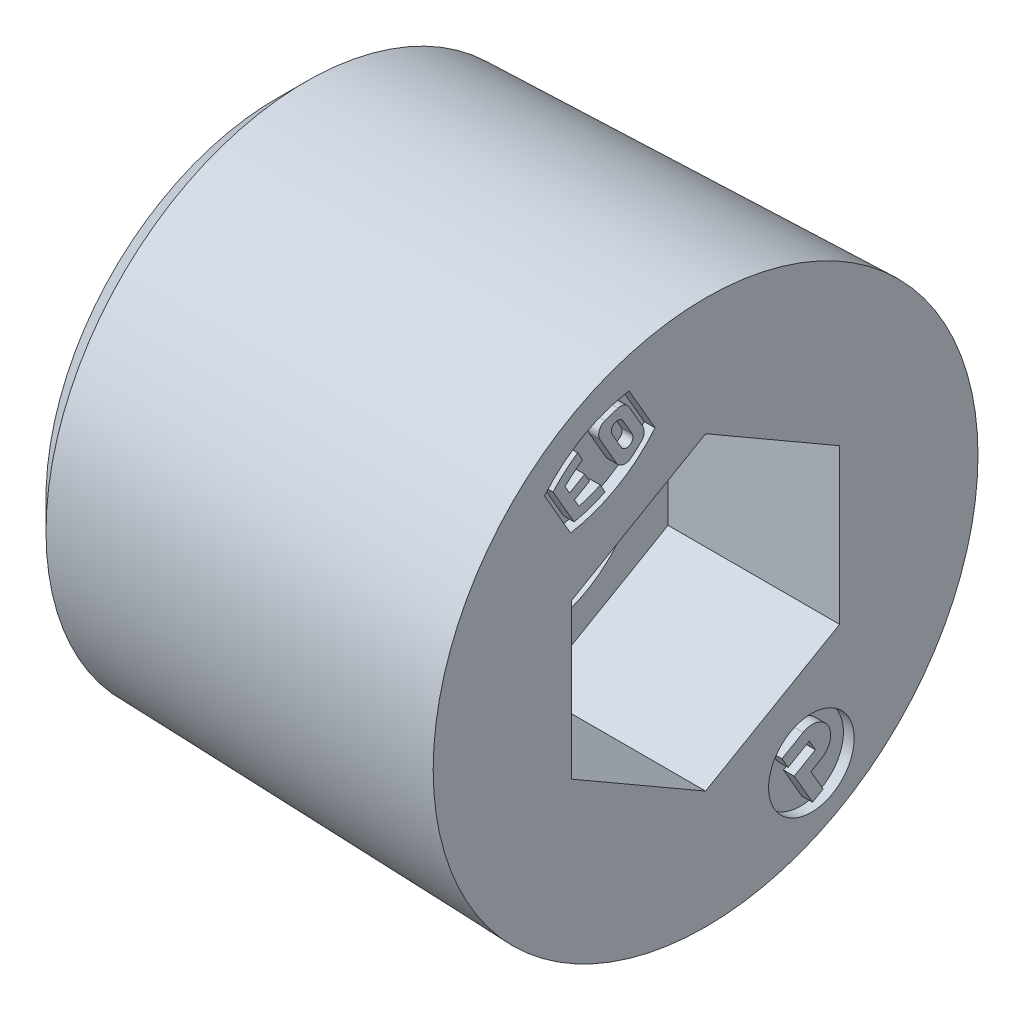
ISO-10303-21;
HEADER;
FILE_DESCRIPTION(('STEP AP214'),'2;1');
FILE_NAME('part.step','',(''),(''),'','','');
FILE_SCHEMA(('AUTOMOTIVE_DESIGN { 1 0 10303 214 1 1 1 1 }'));
ENDSEC;
DATA;
#1=APPLICATION_CONTEXT('core data for automotive mechanical design processes');
#2=APPLICATION_PROTOCOL_DEFINITION('international standard','automotive_design',2000,#1);
#3=PRODUCT_CONTEXT('',#1,'mechanical');
#4=PRODUCT('Part','Part','',(#3));
#5=PRODUCT_RELATED_PRODUCT_CATEGORY('part','',(#4));
#6=PRODUCT_DEFINITION_FORMATION('','',#4);
#7=PRODUCT_DEFINITION_CONTEXT('part definition',#1,'design');
#8=PRODUCT_DEFINITION('design','',#6,#7);
#9=PRODUCT_DEFINITION_SHAPE('','',#8);
#10=(LENGTH_UNIT() NAMED_UNIT(*) SI_UNIT(.MILLI.,.METRE.));
#11=(NAMED_UNIT(*) PLANE_ANGLE_UNIT() SI_UNIT($,.RADIAN.));
#12=(NAMED_UNIT(*) SI_UNIT($,.STERADIAN.) SOLID_ANGLE_UNIT());
#13=UNCERTAINTY_MEASURE_WITH_UNIT(LENGTH_MEASURE(1.E-05),#10,'distance_accuracy_value','');
#14=(GEOMETRIC_REPRESENTATION_CONTEXT(3) GLOBAL_UNCERTAINTY_ASSIGNED_CONTEXT((#13)) GLOBAL_UNIT_ASSIGNED_CONTEXT((#10,
#11,#12)) REPRESENTATION_CONTEXT('',''));
#15=CARTESIAN_POINT('',(0.,0.,0.));
#16=DIRECTION('',(0.,0.,1.));
#17=DIRECTION('',(1.,0.,0.));
#18=AXIS2_PLACEMENT_3D('',#15,#16,#17);
#19=CARTESIAN_POINT('',(0.,-3.14514256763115,-1.99136340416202));
#20=DIRECTION('',(1.,0.,0.));
#21=DIRECTION('',(0.,1.,0.));
#22=AXIS2_PLACEMENT_3D('',#19,#20,#21);
#23=PLANE('',#22);
#24=DIRECTION('',(0.,-0.5,0.866025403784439));
#25=VECTOR('',#24,1.);
#26=CARTESIAN_POINT('',(0.,-2.84896188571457,-1.82036339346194));
#27=LINE('',#26,#25);
#28=CARTESIAN_POINT('',(0.,-2.84896188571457,-1.82036339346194));
#29=VERTEX_POINT('',#28);
#30=CARTESIAN_POINT('',(0.,-3.07696188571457,-1.42545580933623));
#31=VERTEX_POINT('',#30);
#32=EDGE_CURVE('E596',#29,#31,#27,.T.);
#33=ORIENTED_EDGE('',*,*,#32,.T.);
#34=DIRECTION('',(0.,-0.866025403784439,-0.5));
#35=VECTOR('',#34,1.);
#36=CARTESIAN_POINT('',(0.,-3.07696188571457,-1.42545580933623));
#37=LINE('',#36,#35);
#38=CARTESIAN_POINT('',(0.,-3.27441567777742,-1.53945580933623));
#39=VERTEX_POINT('',#38);
#40=EDGE_CURVE('E612',#31,#39,#37,.T.);
#41=ORIENTED_EDGE('',*,*,#40,.T.);
#42=DIRECTION('',(0.,0.5,-0.866025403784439));
#43=VECTOR('',#42,1.);
#44=CARTESIAN_POINT('',(0.,-3.27441567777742,-1.53945580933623));
#45=LINE('',#44,#43);
#46=CARTESIAN_POINT('',(0.,-3.04641567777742,-1.93436339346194));
#47=VERTEX_POINT('',#46);
#48=EDGE_CURVE('E802',#39,#47,#45,.T.);
#49=ORIENTED_EDGE('',*,*,#48,.T.);
#50=DIRECTION('',(0.,-0.866025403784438,-0.5));
#51=VECTOR('',#50,1.);
#52=CARTESIAN_POINT('',(0.,-3.04641567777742,-1.93436339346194));
#53=LINE('',#52,#51);
#54=CARTESIAN_POINT('',(0.,-3.24386946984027,-2.04836339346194));
#55=VERTEX_POINT('',#54);
#56=EDGE_CURVE('E481',#47,#55,#53,.T.);
#57=ORIENTED_EDGE('',*,*,#56,.T.);
#58=DIRECTION('',(0.,-0.5,0.866025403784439));
#59=VECTOR('',#58,1.);
#60=CARTESIAN_POINT('',(0.,-3.24386946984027,-2.04836339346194));
#61=LINE('',#60,#59);
#62=CARTESIAN_POINT('',(0.,-3.47186946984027,-1.65345580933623));
#63=VERTEX_POINT('',#62);
#64=EDGE_CURVE('E480',#55,#63,#61,.T.);
#65=ORIENTED_EDGE('',*,*,#64,.T.);
#66=DIRECTION('',(0.,-0.866025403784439,-0.5));
#67=VECTOR('',#66,1.);
#68=CARTESIAN_POINT('',(0.,-3.47186946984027,-1.65345580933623));
#69=LINE('',#68,#67);
#70=CARTESIAN_POINT('',(0.,-4.06423084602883,-1.99545580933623));
#71=VERTEX_POINT('',#70);
#72=EDGE_CURVE('E607',#63,#71,#69,.T.);
#73=ORIENTED_EDGE('',*,*,#72,.T.);
#74=DIRECTION('',(0.,0.5,-0.866025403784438));
#75=VECTOR('',#74,1.);
#76=CARTESIAN_POINT('',(0.,-4.06423084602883,-1.99545580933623));
#77=LINE('',#76,#75);
#78=CARTESIAN_POINT('',(0.,-3.95023084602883,-2.19290960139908));
#79=VERTEX_POINT('',#78);
#80=EDGE_CURVE('E574',#71,#79,#77,.T.);
#81=ORIENTED_EDGE('',*,*,#80,.T.);
#82=DIRECTION('',(0.,0.866025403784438,0.5));
#83=VECTOR('',#82,1.);
#84=CARTESIAN_POINT('',(0.,-3.95023084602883,-2.19290960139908));
#85=LINE('',#84,#83);
#86=CARTESIAN_POINT('',(0.,-3.55532326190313,-1.96490960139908));
#87=VERTEX_POINT('',#86);
#88=EDGE_CURVE('E569',#79,#87,#85,.T.);
#89=ORIENTED_EDGE('',*,*,#88,.T.);
#90=DIRECTION('',(0.,0.5,-0.866025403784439));
#91=VECTOR('',#90,1.);
#92=CARTESIAN_POINT('',(0.,-3.55532326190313,-1.96490960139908));
#93=LINE('',#92,#91);
#94=CARTESIAN_POINT('',(0.,-3.44132326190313,-2.16236339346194));
#95=VERTEX_POINT('',#94);
#96=EDGE_CURVE('E391',#87,#95,#93,.T.);
#97=ORIENTED_EDGE('',*,*,#96,.T.);
#98=CARTESIAN_POINT('',(0.,-3.14514256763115,-1.99136340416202));
#99=DIRECTION('',(1.,0.,0.));
#100=DIRECTION('',(0.,0.,-1.));
#101=AXIS2_PLACEMENT_3D('',#98,#99,#100);
#102=CIRCLE('',#101,0.342);
#103=EDGE_CURVE('E11',#95,#29,#102,.T.);
#104=ORIENTED_EDGE('',*,*,#103,.T.);
#105=EDGE_LOOP('',(#33,#41,#49,#57,#65,#73,#81,#89,#97,#104));
#106=FACE_BOUND('',#105,.T.);
#107=ADVANCED_FACE('F16',(#106),#23,.T.);
#108=CARTESIAN_POINT('',(-0.2,-3.14514256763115,-1.99136340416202));
#109=DIRECTION('',(-1.,0.,0.));
#110=DIRECTION('',(0.,0.,-1.));
#111=AXIS2_PLACEMENT_3D('',#108,#109,#110);
#112=CYLINDRICAL_SURFACE('',#111,0.342);
#113=ORIENTED_EDGE('',*,*,#103,.F.);
#114=DIRECTION('',(1.,0.,0.));
#115=VECTOR('',#114,1.);
#116=CARTESIAN_POINT('',(-0.2,-3.44132326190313,-2.16236339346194));
#117=LINE('',#116,#115);
#118=CARTESIAN_POINT('',(-0.2,-3.44132326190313,-2.16236339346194));
#119=VERTEX_POINT('',#118);
#120=EDGE_CURVE('E27',#119,#95,#117,.T.);
#121=ORIENTED_EDGE('',*,*,#120,.F.);
#122=CARTESIAN_POINT('',(-0.2,-3.14514256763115,-1.99136340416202));
#123=DIRECTION('',(1.,0.,0.));
#124=DIRECTION('',(0.,0.,-1.));
#125=AXIS2_PLACEMENT_3D('',#122,#123,#124);
#126=CIRCLE('',#125,0.342);
#127=CARTESIAN_POINT('',(-0.2,-2.84896188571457,-1.82036339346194));
#128=VERTEX_POINT('',#127);
#129=EDGE_CURVE('E386',#119,#128,#126,.T.);
#130=ORIENTED_EDGE('',*,*,#129,.T.);
#131=DIRECTION('',(1.,0.,0.));
#132=VECTOR('',#131,1.);
#133=CARTESIAN_POINT('',(-0.2,-2.84896188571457,-1.82036339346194));
#134=LINE('',#133,#132);
#135=EDGE_CURVE('E592',#128,#29,#134,.T.);
#136=ORIENTED_EDGE('',*,*,#135,.T.);
#137=EDGE_LOOP('',(#113,#121,#130,#136));
#138=FACE_BOUND('',#137,.T.);
#139=ADVANCED_FACE('F384',(#138),#112,.T.);
#140=CARTESIAN_POINT('',(-0.2,-3.55532326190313,-1.96490960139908));
#141=DIRECTION('',(0.,-0.866025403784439,-0.5));
#142=DIRECTION('',(0.,0.5,-0.866025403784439));
#143=AXIS2_PLACEMENT_3D('',#140,#141,#142);
#144=PLANE('',#143);
#145=ORIENTED_EDGE('',*,*,#96,.F.);
#146=DIRECTION('',(1.,0.,0.));
#147=VECTOR('',#146,1.);
#148=CARTESIAN_POINT('',(-0.2,-3.55532326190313,-1.96490960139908));
#149=LINE('',#148,#147);
#150=CARTESIAN_POINT('',(-0.2,-3.55532326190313,-1.96490960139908));
#151=VERTEX_POINT('',#150);
#152=EDGE_CURVE('E396',#151,#87,#149,.T.);
#153=ORIENTED_EDGE('',*,*,#152,.F.);
#154=DIRECTION('',(0.,0.5,-0.866025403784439));
#155=VECTOR('',#154,1.);
#156=CARTESIAN_POINT('',(-0.2,-3.55532326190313,-1.96490960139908));
#157=LINE('',#156,#155);
#158=EDGE_CURVE('E394',#151,#119,#157,.T.);
#159=ORIENTED_EDGE('',*,*,#158,.T.);
#160=ORIENTED_EDGE('',*,*,#120,.T.);
#161=EDGE_LOOP('',(#145,#153,#159,#160));
#162=FACE_BOUND('',#161,.T.);
#163=ADVANCED_FACE('F18',(#162),#144,.T.);
#164=CARTESIAN_POINT('',(-0.2,-3.95023084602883,-2.19290960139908));
#165=DIRECTION('',(0.,0.5,-0.866025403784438));
#166=DIRECTION('',(-1.,0.,0.));
#167=AXIS2_PLACEMENT_3D('',#164,#165,#166);
#168=PLANE('',#167);
#169=ORIENTED_EDGE('',*,*,#88,.F.);
#170=DIRECTION('',(1.,0.,0.));
#171=VECTOR('',#170,1.);
#172=CARTESIAN_POINT('',(-0.2,-3.95023084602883,-2.19290960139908));
#173=LINE('',#172,#171);
#174=CARTESIAN_POINT('',(-0.2,-3.95023084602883,-2.19290960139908));
#175=VERTEX_POINT('',#174);
#176=EDGE_CURVE('E573',#175,#79,#173,.T.);
#177=ORIENTED_EDGE('',*,*,#176,.F.);
#178=DIRECTION('',(0.,0.866025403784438,0.5));
#179=VECTOR('',#178,1.);
#180=CARTESIAN_POINT('',(-0.2,-3.95023084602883,-2.19290960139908));
#181=LINE('',#180,#179);
#182=EDGE_CURVE('E401',#175,#151,#181,.T.);
#183=ORIENTED_EDGE('',*,*,#182,.T.);
#184=ORIENTED_EDGE('',*,*,#152,.T.);
#185=EDGE_LOOP('',(#169,#177,#183,#184));
#186=FACE_BOUND('',#185,.T.);
#187=ADVANCED_FACE('F1242',(#186),#168,.T.);
#188=CARTESIAN_POINT('',(-0.2,-4.06423084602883,-1.99545580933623));
#189=DIRECTION('',(0.,-0.866025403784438,-0.5));
#190=DIRECTION('',(0.,0.5,-0.866025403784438));
#191=AXIS2_PLACEMENT_3D('',#188,#189,#190);
#192=PLANE('',#191);
#193=ORIENTED_EDGE('',*,*,#80,.F.);
#194=DIRECTION('',(1.,0.,0.));
#195=VECTOR('',#194,1.);
#196=CARTESIAN_POINT('',(-0.2,-4.06423084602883,-1.99545580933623));
#197=LINE('',#196,#195);
#198=CARTESIAN_POINT('',(-0.2,-4.06423084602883,-1.99545580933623));
#199=VERTEX_POINT('',#198);
#200=EDGE_CURVE('E578',#199,#71,#197,.T.);
#201=ORIENTED_EDGE('',*,*,#200,.F.);
#202=DIRECTION('',(0.,0.5,-0.866025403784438));
#203=VECTOR('',#202,1.);
#204=CARTESIAN_POINT('',(-0.2,-4.06423084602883,-1.99545580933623));
#205=LINE('',#204,#203);
#206=EDGE_CURVE('E544',#199,#175,#205,.T.);
#207=ORIENTED_EDGE('',*,*,#206,.T.);
#208=ORIENTED_EDGE('',*,*,#176,.T.);
#209=EDGE_LOOP('',(#193,#201,#207,#208));
#210=FACE_BOUND('',#209,.T.);
#211=ADVANCED_FACE('F1237',(#210),#192,.T.);
#212=CARTESIAN_POINT('',(-0.2,-3.47186946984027,-1.65345580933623));
#213=DIRECTION('',(0.,-0.5,0.866025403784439));
#214=DIRECTION('',(-1.,0.,0.));
#215=AXIS2_PLACEMENT_3D('',#212,#213,#214);
#216=PLANE('',#215);
#217=ORIENTED_EDGE('',*,*,#72,.F.);
#218=DIRECTION('',(1.,0.,0.));
#219=VECTOR('',#218,1.);
#220=CARTESIAN_POINT('',(-0.2,-3.47186946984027,-1.65345580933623));
#221=LINE('',#220,#219);
#222=CARTESIAN_POINT('',(-0.2,-3.47186946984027,-1.65345580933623));
#223=VERTEX_POINT('',#222);
#224=EDGE_CURVE('E611',#223,#63,#221,.T.);
#225=ORIENTED_EDGE('',*,*,#224,.F.);
#226=DIRECTION('',(0.,-0.866025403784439,-0.5));
#227=VECTOR('',#226,1.);
#228=CARTESIAN_POINT('',(-0.2,-3.47186946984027,-1.65345580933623));
#229=LINE('',#228,#227);
#230=EDGE_CURVE('E656',#223,#199,#229,.T.);
#231=ORIENTED_EDGE('',*,*,#230,.T.);
#232=ORIENTED_EDGE('',*,*,#200,.T.);
#233=EDGE_LOOP('',(#217,#225,#231,#232));
#234=FACE_BOUND('',#233,.T.);
#235=ADVANCED_FACE('F1088',(#234),#216,.T.);
#236=CARTESIAN_POINT('',(-0.2,-3.24386946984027,-2.04836339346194));
#237=DIRECTION('',(0.,0.866025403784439,0.5));
#238=DIRECTION('',(1.,0.,0.));
#239=AXIS2_PLACEMENT_3D('',#236,#237,#238);
#240=PLANE('',#239);
#241=ORIENTED_EDGE('',*,*,#64,.F.);
#242=DIRECTION('',(1.,0.,0.));
#243=VECTOR('',#242,1.);
#244=CARTESIAN_POINT('',(-0.2,-3.24386946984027,-2.04836339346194));
#245=LINE('',#244,#243);
#246=CARTESIAN_POINT('',(-0.2,-3.24386946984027,-2.04836339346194));
#247=VERTEX_POINT('',#246);
#248=EDGE_CURVE('E476',#247,#55,#245,.T.);
#249=ORIENTED_EDGE('',*,*,#248,.F.);
#250=DIRECTION('',(0.,-0.5,0.866025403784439));
#251=VECTOR('',#250,1.);
#252=CARTESIAN_POINT('',(-0.2,-3.24386946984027,-2.04836339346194));
#253=LINE('',#252,#251);
#254=EDGE_CURVE('E588',#247,#223,#253,.T.);
#255=ORIENTED_EDGE('',*,*,#254,.T.);
#256=ORIENTED_EDGE('',*,*,#224,.T.);
#257=EDGE_LOOP('',(#241,#249,#255,#256));
#258=FACE_BOUND('',#257,.T.);
#259=ADVANCED_FACE('F1082',(#258),#240,.T.);
#260=CARTESIAN_POINT('',(-0.2,-3.04641567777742,-1.93436339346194));
#261=DIRECTION('',(0.,-0.5,0.866025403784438));
#262=DIRECTION('',(-1.,0.,0.));
#263=AXIS2_PLACEMENT_3D('',#260,#261,#262);
#264=PLANE('',#263);
#265=ORIENTED_EDGE('',*,*,#56,.F.);
#266=DIRECTION('',(1.,0.,0.));
#267=VECTOR('',#266,1.);
#268=CARTESIAN_POINT('',(-0.2,-3.04641567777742,-1.93436339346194));
#269=LINE('',#268,#267);
#270=CARTESIAN_POINT('',(-0.2,-3.04641567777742,-1.93436339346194));
#271=VERTEX_POINT('',#270);
#272=EDGE_CURVE('E719',#271,#47,#269,.T.);
#273=ORIENTED_EDGE('',*,*,#272,.F.);
#274=DIRECTION('',(0.,-0.866025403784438,-0.5));
#275=VECTOR('',#274,1.);
#276=CARTESIAN_POINT('',(-0.2,-3.04641567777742,-1.93436339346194));
#277=LINE('',#276,#275);
#278=EDGE_CURVE('E583',#271,#247,#277,.T.);
#279=ORIENTED_EDGE('',*,*,#278,.T.);
#280=ORIENTED_EDGE('',*,*,#248,.T.);
#281=EDGE_LOOP('',(#265,#273,#279,#280));
#282=FACE_BOUND('',#281,.T.);
#283=ADVANCED_FACE('F1087',(#282),#264,.T.);
#284=CARTESIAN_POINT('',(-0.2,-3.27441567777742,-1.53945580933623));
#285=DIRECTION('',(0.,-0.866025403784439,-0.5));
#286=DIRECTION('',(0.,0.5,-0.866025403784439));
#287=AXIS2_PLACEMENT_3D('',#284,#285,#286);
#288=PLANE('',#287);
#289=ORIENTED_EDGE('',*,*,#48,.F.);
#290=DIRECTION('',(1.,0.,0.));
#291=VECTOR('',#290,1.);
#292=CARTESIAN_POINT('',(-0.2,-3.27441567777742,-1.53945580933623));
#293=LINE('',#292,#291);
#294=CARTESIAN_POINT('',(-0.2,-3.27441567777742,-1.53945580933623));
#295=VERTEX_POINT('',#294);
#296=EDGE_CURVE('E616',#295,#39,#293,.T.);
#297=ORIENTED_EDGE('',*,*,#296,.F.);
#298=DIRECTION('',(0.,0.5,-0.866025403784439));
#299=VECTOR('',#298,1.);
#300=CARTESIAN_POINT('',(-0.2,-3.27441567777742,-1.53945580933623));
#301=LINE('',#300,#299);
#302=EDGE_CURVE('E587',#295,#271,#301,.T.);
#303=ORIENTED_EDGE('',*,*,#302,.T.);
#304=ORIENTED_EDGE('',*,*,#272,.T.);
#305=EDGE_LOOP('',(#289,#297,#303,#304));
#306=FACE_BOUND('',#305,.T.);
#307=ADVANCED_FACE('F1151',(#306),#288,.T.);
#308=CARTESIAN_POINT('',(-0.2,-3.07696188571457,-1.42545580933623));
#309=DIRECTION('',(0.,-0.5,0.866025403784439));
#310=DIRECTION('',(-1.,0.,0.));
#311=AXIS2_PLACEMENT_3D('',#308,#309,#310);
#312=PLANE('',#311);
#313=ORIENTED_EDGE('',*,*,#40,.F.);
#314=DIRECTION('',(1.,0.,0.));
#315=VECTOR('',#314,1.);
#316=CARTESIAN_POINT('',(-0.2,-3.07696188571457,-1.42545580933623));
#317=LINE('',#316,#315);
#318=CARTESIAN_POINT('',(-0.2,-3.07696188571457,-1.42545580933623));
#319=VERTEX_POINT('',#318);
#320=EDGE_CURVE('E595',#319,#31,#317,.T.);
#321=ORIENTED_EDGE('',*,*,#320,.F.);
#322=DIRECTION('',(0.,-0.866025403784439,-0.5));
#323=VECTOR('',#322,1.);
#324=CARTESIAN_POINT('',(-0.2,-3.07696188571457,-1.42545580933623));
#325=LINE('',#324,#323);
#326=EDGE_CURVE('E649',#319,#295,#325,.T.);
#327=ORIENTED_EDGE('',*,*,#326,.T.);
#328=ORIENTED_EDGE('',*,*,#296,.T.);
#329=EDGE_LOOP('',(#313,#321,#327,#328));
#330=FACE_BOUND('',#329,.T.);
#331=ADVANCED_FACE('F1369',(#330),#312,.T.);
#332=CARTESIAN_POINT('',(-0.2,-2.84896188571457,-1.82036339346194));
#333=DIRECTION('',(0.,0.866025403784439,0.5));
#334=DIRECTION('',(1.,0.,0.));
#335=AXIS2_PLACEMENT_3D('',#332,#333,#334);
#336=PLANE('',#335);
#337=ORIENTED_EDGE('',*,*,#32,.F.);
#338=ORIENTED_EDGE('',*,*,#135,.F.);
#339=DIRECTION('',(0.,-0.5,0.866025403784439));
#340=VECTOR('',#339,1.);
#341=CARTESIAN_POINT('',(-0.2,-2.84896188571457,-1.82036339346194));
#342=LINE('',#341,#340);
#343=EDGE_CURVE('E407',#128,#319,#342,.T.);
#344=ORIENTED_EDGE('',*,*,#343,.T.);
#345=ORIENTED_EDGE('',*,*,#320,.T.);
#346=EDGE_LOOP('',(#337,#338,#344,#345));
#347=FACE_BOUND('',#346,.T.);
#348=ADVANCED_FACE('F961',(#347),#336,.T.);
#349=CARTESIAN_POINT('',(-0.2,-3.4185963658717,-1.9737275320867));
#350=DIRECTION('',(1.,0.,0.));
#351=DIRECTION('',(0.,1.,0.));
#352=AXIS2_PLACEMENT_3D('',#349,#350,#351);
#353=PLANE('',#352);
#354=ORIENTED_EDGE('',*,*,#343,.F.);
#355=ORIENTED_EDGE('',*,*,#129,.F.);
#356=ORIENTED_EDGE('',*,*,#158,.F.);
#357=ORIENTED_EDGE('',*,*,#182,.F.);
#358=ORIENTED_EDGE('',*,*,#206,.F.);
#359=ORIENTED_EDGE('',*,*,#230,.F.);
#360=ORIENTED_EDGE('',*,*,#254,.F.);
#361=ORIENTED_EDGE('',*,*,#278,.F.);
#362=ORIENTED_EDGE('',*,*,#302,.F.);
#363=ORIENTED_EDGE('',*,*,#326,.F.);
#364=EDGE_LOOP('',(#354,#355,#356,#357,#358,#359,#360,#361,#362,#363));
#365=FACE_BOUND('',#364,.T.);
#366=CARTESIAN_POINT('',(-0.2,-3.4185963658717,-1.9737275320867));
#367=DIRECTION('',(1.,0.,0.));
#368=DIRECTION('',(0.,0.,-1.));
#369=AXIS2_PLACEMENT_3D('',#366,#367,#368);
#370=CIRCLE('',#369,0.798);
#371=CARTESIAN_POINT('',(-0.2,-3.4185963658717,-2.7717275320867));
#372=VERTEX_POINT('',#371);
#373=EDGE_CURVE('E414',#372,#372,#370,.T.);
#374=ORIENTED_EDGE('',*,*,#373,.T.);
#375=EDGE_LOOP('',(#374));
#376=FACE_BOUND('',#375,.T.);
#377=ADVANCED_FACE('F403',(#365,#376),#353,.T.);
#378=CARTESIAN_POINT('',(-0.2,-3.4185963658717,-1.9737275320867));
#379=DIRECTION('',(-1.,0.,0.));
#380=DIRECTION('',(0.,0.,-1.));
#381=AXIS2_PLACEMENT_3D('',#378,#379,#380);
#382=CYLINDRICAL_SURFACE('',#381,0.798);
#383=ORIENTED_EDGE('',*,*,#373,.F.);
#384=EDGE_LOOP('',(#383));
#385=FACE_BOUND('',#384,.T.);
#386=CARTESIAN_POINT('',(0.,-3.4185963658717,-1.9737275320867));
#387=DIRECTION('',(1.,0.,0.));
#388=DIRECTION('',(0.,0.,-1.));
#389=AXIS2_PLACEMENT_3D('',#386,#387,#388);
#390=CIRCLE('',#389,0.798);
#391=CARTESIAN_POINT('',(0.,-3.4185963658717,-2.7717275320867));
#392=VERTEX_POINT('',#391);
#393=EDGE_CURVE('E660',#392,#392,#390,.T.);
#394=ORIENTED_EDGE('',*,*,#393,.T.);
#395=EDGE_LOOP('',(#394));
#396=FACE_BOUND('',#395,.T.);
#397=ADVANCED_FACE('F960',(#385,#396),#382,.F.);
#398=CARTESIAN_POINT('',(-0.2,1.72984682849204,0.998727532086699));
#399=DIRECTION('',(1.,0.,0.));
#400=DIRECTION('',(0.,1.,0.));
#401=AXIS2_PLACEMENT_3D('',#398,#399,#400);
#402=PLANE('',#401);
#403=CARTESIAN_POINT('',(-0.2,3.51273807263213,1.47266931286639));
#404=DIRECTION('',(1.,0.,0.));
#405=DIRECTION('',(0.,0.,-1.));
#406=AXIS2_PLACEMENT_3D('',#403,#404,#405);
#407=CIRCLE('',#406,0.117);
#408=CARTESIAN_POINT('',(-0.2,3.45423807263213,1.57399428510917));
#409=VERTEX_POINT('',#408);
#410=CARTESIAN_POINT('',(-0.2,3.57123807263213,1.37134434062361));
#411=VERTEX_POINT('',#410);
#412=EDGE_CURVE('E465',#409,#411,#407,.T.);
#413=ORIENTED_EDGE('',*,*,#412,.T.);
#414=DIRECTION('',(0.,0.866025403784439,0.5));
#415=VECTOR('',#414,1.);
#416=CARTESIAN_POINT('',(-0.2,3.57123807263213,1.37134434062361));
#417=LINE('',#416,#415);
#418=CARTESIAN_POINT('',(-0.2,3.86395465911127,1.54034434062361));
#419=VERTEX_POINT('',#418);
#420=EDGE_CURVE('E452',#411,#419,#417,.T.);
#421=ORIENTED_EDGE('',*,*,#420,.T.);
#422=CARTESIAN_POINT('',(-0.2,3.80545465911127,1.64166931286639));
#423=DIRECTION('',(1.,0.,0.));
#424=DIRECTION('',(0.,0.,-1.));
#425=AXIS2_PLACEMENT_3D('',#422,#423,#424);
#426=CIRCLE('',#425,0.117);
#427=CARTESIAN_POINT('',(-0.2,3.74695465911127,1.74299428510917));
#428=VERTEX_POINT('',#427);
#429=EDGE_CURVE('E420',#419,#428,#426,.T.);
#430=ORIENTED_EDGE('',*,*,#429,.T.);
#431=DIRECTION('',(0.,-0.866025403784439,-0.5));
#432=VECTOR('',#431,1.);
#433=CARTESIAN_POINT('',(-0.2,3.74695465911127,1.74299428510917));
#434=LINE('',#433,#432);
#435=EDGE_CURVE('E735',#428,#409,#434,.T.);
#436=ORIENTED_EDGE('',*,*,#435,.T.);
#437=EDGE_LOOP('',(#413,#421,#430,#436));
#438=FACE_BOUND('',#437,.T.);
#439=ADVANCED_FACE('F1353',(#438),#402,.T.);
#440=CARTESIAN_POINT('',(0.,1.72984682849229,0.998727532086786));
#441=DIRECTION('',(1.,0.,0.));
#442=DIRECTION('',(0.,1.,0.));
#443=AXIS2_PLACEMENT_3D('',#440,#441,#442);
#444=PLANE('',#443);
#445=DIRECTION('',(0.,0.866025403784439,0.5));
#446=VECTOR('',#445,1.);
#447=CARTESIAN_POINT('',(0.,3.57123807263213,1.37134434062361));
#448=LINE('',#447,#446);
#449=CARTESIAN_POINT('',(0.,3.57123807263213,1.37134434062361));
#450=VERTEX_POINT('',#449);
#451=CARTESIAN_POINT('',(0.,3.86395465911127,1.54034434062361));
#452=VERTEX_POINT('',#451);
#453=EDGE_CURVE('E445',#450,#452,#448,.T.);
#454=ORIENTED_EDGE('',*,*,#453,.F.);
#455=CARTESIAN_POINT('',(0.,3.51273807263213,1.47266931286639));
#456=DIRECTION('',(1.,0.,0.));
#457=DIRECTION('',(0.,0.,-1.));
#458=AXIS2_PLACEMENT_3D('',#455,#456,#457);
#459=CIRCLE('',#458,0.117);
#460=CARTESIAN_POINT('',(0.,3.45423807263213,1.57399428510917));
#461=VERTEX_POINT('',#460);
#462=EDGE_CURVE('E451',#461,#450,#459,.T.);
#463=ORIENTED_EDGE('',*,*,#462,.F.);
#464=DIRECTION('',(0.,-0.866025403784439,-0.5));
#465=VECTOR('',#464,1.);
#466=CARTESIAN_POINT('',(0.,3.74695465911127,1.74299428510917));
#467=LINE('',#466,#465);
#468=CARTESIAN_POINT('',(0.,3.74695465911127,1.74299428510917));
#469=VERTEX_POINT('',#468);
#470=EDGE_CURVE('E582',#469,#461,#467,.T.);
#471=ORIENTED_EDGE('',*,*,#470,.F.);
#472=CARTESIAN_POINT('',(0.,3.80545465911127,1.64166931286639));
#473=DIRECTION('',(1.,0.,0.));
#474=DIRECTION('',(0.,0.,-1.));
#475=AXIS2_PLACEMENT_3D('',#472,#473,#474);
#476=CIRCLE('',#475,0.117);
#477=EDGE_CURVE('E423',#452,#469,#476,.T.);
#478=ORIENTED_EDGE('',*,*,#477,.F.);
#479=EDGE_LOOP('',(#454,#463,#471,#478));
#480=FACE_BOUND('',#479,.T.);
#481=CARTESIAN_POINT('',(0.,1.72984682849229,0.998727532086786));
#482=DIRECTION('',(1.,0.,0.));
#483=DIRECTION('',(0.,0.,-1.));
#484=AXIS2_PLACEMENT_3D('',#481,#482,#483);
#485=CIRCLE('',#484,2.47);
#486=CARTESIAN_POINT('',(0.,4.11736002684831,1.63172099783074));
#487=VERTEX_POINT('',#486);
#488=CARTESIAN_POINT('',(0.,4.03816335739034,1.87768987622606));
#489=VERTEX_POINT('',#488);
#490=EDGE_CURVE('E564',#487,#489,#485,.T.);
#491=ORIENTED_EDGE('',*,*,#490,.T.);
#492=CARTESIAN_POINT('',(0.,3.86807687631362,1.81292422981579));
#493=DIRECTION('',(1.,0.,0.));
#494=DIRECTION('',(0.,0.,-1.));
#495=AXIS2_PLACEMENT_3D('',#492,#493,#494);
#496=CIRCLE('',#495,0.182);
#497=CARTESIAN_POINT('',(0.,3.77707687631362,1.97054085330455));
#498=VERTEX_POINT('',#497);
#499=EDGE_CURVE('E604',#489,#498,#496,.T.);
#500=ORIENTED_EDGE('',*,*,#499,.T.);
#501=DIRECTION('',(0.,-0.866025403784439,-0.5));
#502=VECTOR('',#501,1.);
#503=CARTESIAN_POINT('',(0.,3.77707687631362,1.97054085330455));
#504=LINE('',#503,#502);
#505=CARTESIAN_POINT('',(0.,3.24211585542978,1.66168096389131));
#506=VERTEX_POINT('',#505);
#507=EDGE_CURVE('E703',#498,#506,#504,.T.);
#508=ORIENTED_EDGE('',*,*,#507,.T.);
#509=CARTESIAN_POINT('',(0.,3.33311585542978,1.50406434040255));
#510=DIRECTION('',(1.,0.,0.));
#511=DIRECTION('',(0.,0.,-1.));
#512=AXIS2_PLACEMENT_3D('',#509,#510,#511);
#513=CIRCLE('',#512,0.182);
#514=CARTESIAN_POINT('',(0.,3.19198391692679,1.38914795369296));
#515=VERTEX_POINT('',#514);
#516=EDGE_CURVE('E630',#506,#515,#513,.T.);
#517=ORIENTED_EDGE('',*,*,#516,.T.);
#518=CARTESIAN_POINT('',(0.,5.10734590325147,2.9487275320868));
#519=DIRECTION('',(1.,0.,0.));
#520=DIRECTION('',(0.,0.,-1.));
#521=AXIS2_PLACEMENT_3D('',#518,#519,#520);
#522=CIRCLE('',#521,2.47);
#523=CARTESIAN_POINT('',(0.,3.36540084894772,1.1975772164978));
#524=VERTEX_POINT('',#523);
#525=EDGE_CURVE('E558',#515,#524,#522,.T.);
#526=ORIENTED_EDGE('',*,*,#525,.T.);
#527=CARTESIAN_POINT('',(0.,3.49375472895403,1.32660931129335));
#528=DIRECTION('',(1.,0.,0.));
#529=DIRECTION('',(0.,0.,-1.));
#530=AXIS2_PLACEMENT_3D('',#527,#528,#529);
#531=CIRCLE('',#530,0.182);
#532=CARTESIAN_POINT('',(0.,3.58475472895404,1.16899268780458));
#533=VERTEX_POINT('',#532);
#534=EDGE_CURVE('E549',#524,#533,#531,.T.);
#535=ORIENTED_EDGE('',*,*,#534,.T.);
#536=DIRECTION('',(0.,0.866025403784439,0.5));
#537=VECTOR('',#536,1.);
#538=CARTESIAN_POINT('',(0.,3.58475472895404,1.16899268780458));
#539=LINE('',#538,#537);
#540=CARTESIAN_POINT('',(0.,4.03243800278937,1.4274627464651));
#541=VERTEX_POINT('',#540);
#542=EDGE_CURVE('E446',#533,#541,#539,.T.);
#543=ORIENTED_EDGE('',*,*,#542,.T.);
#544=CARTESIAN_POINT('',(0.,3.94143800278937,1.58507936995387));
#545=DIRECTION('',(1.,0.,0.));
#546=DIRECTION('',(0.,0.,-1.));
#547=AXIS2_PLACEMENT_3D('',#544,#545,#546);
#548=CIRCLE('',#547,0.182);
#549=EDGE_CURVE('E422',#541,#487,#548,.T.);
#550=ORIENTED_EDGE('',*,*,#549,.T.);
#551=EDGE_LOOP('',(#491,#500,#508,#517,#526,#535,#543,#550));
#552=FACE_BOUND('',#551,.T.);
#553=ADVANCED_FACE('F1347',(#480,#552),#444,.T.);
#554=CARTESIAN_POINT('',(-0.2,3.94143800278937,1.58507936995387));
#555=DIRECTION('',(-1.,0.,0.));
#556=DIRECTION('',(0.,0.,-1.));
#557=AXIS2_PLACEMENT_3D('',#554,#555,#556);
#558=CYLINDRICAL_SURFACE('',#557,0.182);
#559=ORIENTED_EDGE('',*,*,#549,.F.);
#560=DIRECTION('',(1.,0.,0.));
#561=VECTOR('',#560,1.);
#562=CARTESIAN_POINT('',(-0.2,4.03243800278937,1.4274627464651));
#563=LINE('',#562,#561);
#564=CARTESIAN_POINT('',(-0.2,4.03243800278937,1.4274627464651));
#565=VERTEX_POINT('',#564);
#566=EDGE_CURVE('E441',#565,#541,#563,.T.);
#567=ORIENTED_EDGE('',*,*,#566,.F.);
#568=CARTESIAN_POINT('',(-0.2,3.94143800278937,1.58507936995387));
#569=DIRECTION('',(1.,0.,0.));
#570=DIRECTION('',(0.,0.,-1.));
#571=AXIS2_PLACEMENT_3D('',#568,#569,#570);
#572=CIRCLE('',#571,0.182);
#573=CARTESIAN_POINT('',(-0.2,4.11736002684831,1.63172099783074));
#574=VERTEX_POINT('',#573);
#575=EDGE_CURVE('E435',#565,#574,#572,.T.);
#576=ORIENTED_EDGE('',*,*,#575,.T.);
#577=DIRECTION('',(1.,0.,0.));
#578=VECTOR('',#577,1.);
#579=CARTESIAN_POINT('',(-0.2,4.11736002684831,1.63172099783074));
#580=LINE('',#579,#578);
#581=EDGE_CURVE('E568',#574,#487,#580,.T.);
#582=ORIENTED_EDGE('',*,*,#581,.T.);
#583=EDGE_LOOP('',(#559,#567,#576,#582));
#584=FACE_BOUND('',#583,.T.);
#585=ADVANCED_FACE('F1352',(#584),#558,.T.);
#586=CARTESIAN_POINT('',(-0.2,3.80545465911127,1.64166931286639));
#587=DIRECTION('',(-1.,0.,0.));
#588=DIRECTION('',(0.,0.,-1.));
#589=AXIS2_PLACEMENT_3D('',#586,#587,#588);
#590=CYLINDRICAL_SURFACE('',#589,0.117);
#591=ORIENTED_EDGE('',*,*,#477,.T.);
#592=DIRECTION('',(1.,0.,0.));
#593=VECTOR('',#592,1.);
#594=CARTESIAN_POINT('',(-0.2,3.74695465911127,1.74299428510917));
#595=LINE('',#594,#593);
#596=EDGE_CURVE('E557',#428,#469,#595,.T.);
#597=ORIENTED_EDGE('',*,*,#596,.F.);
#598=ORIENTED_EDGE('',*,*,#429,.F.);
#599=DIRECTION('',(1.,0.,0.));
#600=VECTOR('',#599,1.);
#601=CARTESIAN_POINT('',(-0.2,3.86395465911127,1.54034434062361));
#602=LINE('',#601,#600);
#603=EDGE_CURVE('E642',#419,#452,#602,.T.);
#604=ORIENTED_EDGE('',*,*,#603,.T.);
#605=EDGE_LOOP('',(#591,#597,#598,#604));
#606=FACE_BOUND('',#605,.T.);
#607=ADVANCED_FACE('F1179',(#606),#590,.F.);
#608=CARTESIAN_POINT('',(-0.2,3.74695465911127,1.74299428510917));
#609=DIRECTION('',(0.,-0.5,0.866025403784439));
#610=DIRECTION('',(-1.,0.,0.));
#611=AXIS2_PLACEMENT_3D('',#608,#609,#610);
#612=PLANE('',#611);
#613=ORIENTED_EDGE('',*,*,#470,.T.);
#614=DIRECTION('',(1.,0.,0.));
#615=VECTOR('',#614,1.);
#616=CARTESIAN_POINT('',(-0.2,3.45423807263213,1.57399428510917));
#617=LINE('',#616,#615);
#618=EDGE_CURVE('E469',#409,#461,#617,.T.);
#619=ORIENTED_EDGE('',*,*,#618,.F.);
#620=ORIENTED_EDGE('',*,*,#435,.F.);
#621=ORIENTED_EDGE('',*,*,#596,.T.);
#622=EDGE_LOOP('',(#613,#619,#620,#621));
#623=FACE_BOUND('',#622,.T.);
#624=ADVANCED_FACE('F1174',(#623),#612,.F.);
#625=CARTESIAN_POINT('',(-0.2,3.51273807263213,1.47266931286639));
#626=DIRECTION('',(-1.,0.,0.));
#627=DIRECTION('',(0.,0.,-1.));
#628=AXIS2_PLACEMENT_3D('',#625,#626,#627);
#629=CYLINDRICAL_SURFACE('',#628,0.117);
#630=ORIENTED_EDGE('',*,*,#462,.T.);
#631=DIRECTION('',(1.,0.,0.));
#632=VECTOR('',#631,1.);
#633=CARTESIAN_POINT('',(-0.2,3.57123807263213,1.37134434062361));
#634=LINE('',#633,#632);
#635=EDGE_CURVE('E447',#411,#450,#634,.T.);
#636=ORIENTED_EDGE('',*,*,#635,.F.);
#637=ORIENTED_EDGE('',*,*,#412,.F.);
#638=ORIENTED_EDGE('',*,*,#618,.T.);
#639=EDGE_LOOP('',(#630,#636,#637,#638));
#640=FACE_BOUND('',#639,.T.);
#641=ADVANCED_FACE('F1123',(#640),#629,.F.);
#642=CARTESIAN_POINT('',(-0.2,3.57123807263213,1.37134434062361));
#643=DIRECTION('',(0.,0.5,-0.866025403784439));
#644=DIRECTION('',(-1.,0.,0.));
#645=AXIS2_PLACEMENT_3D('',#642,#643,#644);
#646=PLANE('',#645);
#647=ORIENTED_EDGE('',*,*,#453,.T.);
#648=ORIENTED_EDGE('',*,*,#603,.F.);
#649=ORIENTED_EDGE('',*,*,#420,.F.);
#650=ORIENTED_EDGE('',*,*,#635,.T.);
#651=EDGE_LOOP('',(#647,#648,#649,#650));
#652=FACE_BOUND('',#651,.T.);
#653=ADVANCED_FACE('F1117',(#652),#646,.F.);
#654=CARTESIAN_POINT('',(-0.2,3.58475472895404,1.16899268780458));
#655=DIRECTION('',(0.,0.5,-0.866025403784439));
#656=DIRECTION('',(-1.,0.,0.));
#657=AXIS2_PLACEMENT_3D('',#654,#655,#656);
#658=PLANE('',#657);
#659=ORIENTED_EDGE('',*,*,#542,.F.);
#660=DIRECTION('',(1.,0.,0.));
#661=VECTOR('',#660,1.);
#662=CARTESIAN_POINT('',(-0.2,3.58475472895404,1.16899268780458));
#663=LINE('',#662,#661);
#664=CARTESIAN_POINT('',(-0.2,3.58475472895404,1.16899268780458));
#665=VERTEX_POINT('',#664);
#666=EDGE_CURVE('E545',#665,#533,#663,.T.);
#667=ORIENTED_EDGE('',*,*,#666,.F.);
#668=DIRECTION('',(0.,0.866025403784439,0.5));
#669=VECTOR('',#668,1.);
#670=CARTESIAN_POINT('',(-0.2,3.58475472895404,1.16899268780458));
#671=LINE('',#670,#669);
#672=EDGE_CURVE('E439',#665,#565,#671,.T.);
#673=ORIENTED_EDGE('',*,*,#672,.T.);
#674=ORIENTED_EDGE('',*,*,#566,.T.);
#675=EDGE_LOOP('',(#659,#667,#673,#674));
#676=FACE_BOUND('',#675,.T.);
#677=ADVANCED_FACE('F1122',(#676),#658,.T.);
#678=CARTESIAN_POINT('',(-0.2,3.49375472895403,1.32660931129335));
#679=DIRECTION('',(-1.,0.,0.));
#680=DIRECTION('',(0.,0.,-1.));
#681=AXIS2_PLACEMENT_3D('',#678,#679,#680);
#682=CYLINDRICAL_SURFACE('',#681,0.182);
#683=ORIENTED_EDGE('',*,*,#534,.F.);
#684=DIRECTION('',(1.,0.,0.));
#685=VECTOR('',#684,1.);
#686=CARTESIAN_POINT('',(-0.2,3.36540084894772,1.1975772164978));
#687=LINE('',#686,#685);
#688=CARTESIAN_POINT('',(-0.2,3.36540084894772,1.1975772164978));
#689=VERTEX_POINT('',#688);
#690=EDGE_CURVE('E561',#689,#524,#687,.T.);
#691=ORIENTED_EDGE('',*,*,#690,.F.);
#692=CARTESIAN_POINT('',(-0.2,3.49375472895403,1.32660931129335));
#693=DIRECTION('',(1.,0.,0.));
#694=DIRECTION('',(0.,0.,-1.));
#695=AXIS2_PLACEMENT_3D('',#692,#693,#694);
#696=CIRCLE('',#695,0.182);
#697=EDGE_CURVE('E535',#689,#665,#696,.T.);
#698=ORIENTED_EDGE('',*,*,#697,.T.);
#699=ORIENTED_EDGE('',*,*,#666,.T.);
#700=EDGE_LOOP('',(#683,#691,#698,#699));
#701=FACE_BOUND('',#700,.T.);
#702=ADVANCED_FACE('F1222',(#701),#682,.T.);
#703=CARTESIAN_POINT('',(-0.2,5.10734590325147,2.9487275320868));
#704=DIRECTION('',(-1.,0.,0.));
#705=DIRECTION('',(0.,0.,-1.));
#706=AXIS2_PLACEMENT_3D('',#703,#704,#705);
#707=CYLINDRICAL_SURFACE('',#706,2.47);
#708=ORIENTED_EDGE('',*,*,#525,.F.);
#709=DIRECTION('',(1.,0.,0.));
#710=VECTOR('',#709,1.);
#711=CARTESIAN_POINT('',(-0.2,3.19198391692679,1.38914795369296));
#712=LINE('',#711,#710);
#713=CARTESIAN_POINT('',(-0.2,3.19198391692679,1.38914795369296));
#714=VERTEX_POINT('',#713);
#715=EDGE_CURVE('E562',#714,#515,#712,.T.);
#716=ORIENTED_EDGE('',*,*,#715,.F.);
#717=CARTESIAN_POINT('',(-0.2,5.10734590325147,2.9487275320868));
#718=DIRECTION('',(1.,0.,0.));
#719=DIRECTION('',(0.,0.,-1.));
#720=AXIS2_PLACEMENT_3D('',#717,#718,#719);
#721=CIRCLE('',#720,2.47);
#722=EDGE_CURVE('E527',#714,#689,#721,.T.);
#723=ORIENTED_EDGE('',*,*,#722,.T.);
#724=ORIENTED_EDGE('',*,*,#690,.T.);
#725=EDGE_LOOP('',(#708,#716,#723,#724));
#726=FACE_BOUND('',#725,.T.);
#727=ADVANCED_FACE('F1216',(#726),#707,.T.);
#728=CARTESIAN_POINT('',(-0.2,3.33311585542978,1.50406434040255));
#729=DIRECTION('',(-1.,0.,0.));
#730=DIRECTION('',(0.,0.,-1.));
#731=AXIS2_PLACEMENT_3D('',#728,#729,#730);
#732=CYLINDRICAL_SURFACE('',#731,0.182);
#733=ORIENTED_EDGE('',*,*,#516,.F.);
#734=DIRECTION('',(1.,0.,0.));
#735=VECTOR('',#734,1.);
#736=CARTESIAN_POINT('',(-0.2,3.24211585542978,1.66168096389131));
#737=LINE('',#736,#735);
#738=CARTESIAN_POINT('',(-0.2,3.24211585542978,1.66168096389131));
#739=VERTEX_POINT('',#738);
#740=EDGE_CURVE('E634',#739,#506,#737,.T.);
#741=ORIENTED_EDGE('',*,*,#740,.F.);
#742=CARTESIAN_POINT('',(-0.2,3.33311585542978,1.50406434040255));
#743=DIRECTION('',(1.,0.,0.));
#744=DIRECTION('',(0.,0.,-1.));
#745=AXIS2_PLACEMENT_3D('',#742,#743,#744);
#746=CIRCLE('',#745,0.182);
#747=EDGE_CURVE('E523',#739,#714,#746,.T.);
#748=ORIENTED_EDGE('',*,*,#747,.T.);
#749=ORIENTED_EDGE('',*,*,#715,.T.);
#750=EDGE_LOOP('',(#733,#741,#748,#749));
#751=FACE_BOUND('',#750,.T.);
#752=ADVANCED_FACE('F1221',(#751),#732,.T.);
#753=CARTESIAN_POINT('',(-0.2,3.77707687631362,1.97054085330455));
#754=DIRECTION('',(0.,-0.5,0.866025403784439));
#755=DIRECTION('',(-1.,0.,0.));
#756=AXIS2_PLACEMENT_3D('',#753,#754,#755);
#757=PLANE('',#756);
#758=ORIENTED_EDGE('',*,*,#507,.F.);
#759=DIRECTION('',(1.,0.,0.));
#760=VECTOR('',#759,1.);
#761=CARTESIAN_POINT('',(-0.2,3.77707687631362,1.97054085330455));
#762=LINE('',#761,#760);
#763=CARTESIAN_POINT('',(-0.2,3.77707687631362,1.97054085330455));
#764=VERTEX_POINT('',#763);
#765=EDGE_CURVE('E707',#764,#498,#762,.T.);
#766=ORIENTED_EDGE('',*,*,#765,.F.);
#767=DIRECTION('',(0.,-0.866025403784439,-0.5));
#768=VECTOR('',#767,1.);
#769=CARTESIAN_POINT('',(-0.2,3.77707687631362,1.97054085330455));
#770=LINE('',#769,#768);
#771=EDGE_CURVE('E464',#764,#739,#770,.T.);
#772=ORIENTED_EDGE('',*,*,#771,.T.);
#773=ORIENTED_EDGE('',*,*,#740,.T.);
#774=EDGE_LOOP('',(#758,#766,#772,#773));
#775=FACE_BOUND('',#774,.T.);
#776=ADVANCED_FACE('F1276',(#775),#757,.T.);
#777=CARTESIAN_POINT('',(-0.2,3.86807687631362,1.81292422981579));
#778=DIRECTION('',(-1.,0.,0.));
#779=DIRECTION('',(0.,0.,-1.));
#780=AXIS2_PLACEMENT_3D('',#777,#778,#779);
#781=CYLINDRICAL_SURFACE('',#780,0.182);
#782=ORIENTED_EDGE('',*,*,#499,.F.);
#783=DIRECTION('',(1.,0.,0.));
#784=VECTOR('',#783,1.);
#785=CARTESIAN_POINT('',(-0.2,4.03816335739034,1.87768987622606));
#786=LINE('',#785,#784);
#787=CARTESIAN_POINT('',(-0.2,4.03816335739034,1.87768987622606));
#788=VERTEX_POINT('',#787);
#789=EDGE_CURVE('E600',#788,#489,#786,.T.);
#790=ORIENTED_EDGE('',*,*,#789,.F.);
#791=CARTESIAN_POINT('',(-0.2,3.86807687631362,1.81292422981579));
#792=DIRECTION('',(1.,0.,0.));
#793=DIRECTION('',(0.,0.,-1.));
#794=AXIS2_PLACEMENT_3D('',#791,#792,#793);
#795=CIRCLE('',#794,0.182);
#796=EDGE_CURVE('E459',#788,#764,#795,.T.);
#797=ORIENTED_EDGE('',*,*,#796,.T.);
#798=ORIENTED_EDGE('',*,*,#765,.T.);
#799=EDGE_LOOP('',(#782,#790,#797,#798));
#800=FACE_BOUND('',#799,.T.);
#801=ADVANCED_FACE('F1074',(#800),#781,.T.);
#802=CARTESIAN_POINT('',(-0.2,1.72984682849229,0.998727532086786));
#803=DIRECTION('',(-1.,0.,0.));
#804=DIRECTION('',(0.,0.,-1.));
#805=AXIS2_PLACEMENT_3D('',#802,#803,#804);
#806=CYLINDRICAL_SURFACE('',#805,2.47);
#807=ORIENTED_EDGE('',*,*,#490,.F.);
#808=ORIENTED_EDGE('',*,*,#581,.F.);
#809=CARTESIAN_POINT('',(-0.2,1.72984682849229,0.998727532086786));
#810=DIRECTION('',(1.,0.,0.));
#811=DIRECTION('',(0.,0.,-1.));
#812=AXIS2_PLACEMENT_3D('',#809,#810,#811);
#813=CIRCLE('',#812,2.47);
#814=EDGE_CURVE('E440',#574,#788,#813,.T.);
#815=ORIENTED_EDGE('',*,*,#814,.T.);
#816=ORIENTED_EDGE('',*,*,#789,.T.);
#817=EDGE_LOOP('',(#807,#808,#815,#816));
#818=FACE_BOUND('',#817,.T.);
#819=ADVANCED_FACE('F1068',(#818),#806,.T.);
#820=CARTESIAN_POINT('',(0.,1.72984682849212,0.998727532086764));
#821=DIRECTION('',(1.,0.,0.));
#822=DIRECTION('',(0.,1.,0.));
#823=AXIS2_PLACEMENT_3D('',#820,#821,#822);
#824=PLANE('',#823);
#825=CARTESIAN_POINT('',(0.,1.72984682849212,0.998727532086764));
#826=DIRECTION('',(1.,0.,0.));
#827=DIRECTION('',(0.,0.,-1.));
#828=AXIS2_PLACEMENT_3D('',#825,#826,#827);
#829=CIRCLE('',#828,2.47);
#830=CARTESIAN_POINT('',(0.,3.77211474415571,2.38798696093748));
#831=VERTEX_POINT('',#830);
#832=CARTESIAN_POINT('',(0.,3.36947117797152,2.84603151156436));
#833=VERTEX_POINT('',#832);
#834=EDGE_CURVE('E749',#831,#833,#829,.T.);
#835=ORIENTED_EDGE('',*,*,#834,.T.);
#836=DIRECTION('',(0.,-0.866025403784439,-0.5));
#837=VECTOR('',#836,1.);
#838=CARTESIAN_POINT('',(0.,3.36947117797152,2.84603151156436));
#839=LINE('',#838,#837);
#840=CARTESIAN_POINT('',(0.,2.68772155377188,2.45242318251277));
#841=VERTEX_POINT('',#840);
#842=EDGE_CURVE('E739',#833,#841,#839,.T.);
#843=ORIENTED_EDGE('',*,*,#842,.T.);
#844=CARTESIAN_POINT('',(0.,5.10734590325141,2.94872753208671));
#845=DIRECTION('',(1.,0.,0.));
#846=DIRECTION('',(0.,0.,-1.));
#847=AXIS2_PLACEMENT_3D('',#844,#845,#846);
#848=CIRCLE('',#847,2.47);
#849=CARTESIAN_POINT('',(0.,2.88307798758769,1.87470135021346));
#850=VERTEX_POINT('',#849);
#851=EDGE_CURVE('E492',#841,#850,#848,.T.);
#852=ORIENTED_EDGE('',*,*,#851,.T.);
#853=DIRECTION('',(0.,0.866025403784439,0.5));
#854=VECTOR('',#853,1.);
#855=CARTESIAN_POINT('',(0.,2.88307798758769,1.87470135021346));
#856=LINE('',#855,#854);
#857=CARTESIAN_POINT('',(0.,3.04115857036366,1.96596921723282));
#858=VERTEX_POINT('',#857);
#859=EDGE_CURVE('E688',#850,#858,#856,.T.);
#860=ORIENTED_EDGE('',*,*,#859,.T.);
#861=CARTESIAN_POINT('',(0.,5.10734590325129,2.94872753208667));
#862=DIRECTION('',(1.,0.,0.));
#863=DIRECTION('',(0.,0.,-1.));
#864=AXIS2_PLACEMENT_3D('',#861,#862,#863);
#865=CIRCLE('',#864,2.288);
#866=CARTESIAN_POINT('',(0.,2.89575472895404,2.36237569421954));
#867=VERTEX_POINT('',#866);
#868=EDGE_CURVE('E689',#867,#858,#865,.T.);
#869=ORIENTED_EDGE('',*,*,#868,.F.);
#870=DIRECTION('',(0.,0.86602540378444,0.5));
#871=VECTOR('',#870,1.);
#872=CARTESIAN_POINT('',(0.,2.89575472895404,2.36237569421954));
#873=LINE('',#872,#871);
#874=CARTESIAN_POINT('',(0.,3.04078805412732,2.4461107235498));
#875=VERTEX_POINT('',#874);
#876=EDGE_CURVE('E424',#867,#875,#873,.T.);
#877=ORIENTED_EDGE('',*,*,#876,.T.);
#878=DIRECTION('',(0.,0.5,-0.866025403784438));
#879=VECTOR('',#878,1.);
#880=CARTESIAN_POINT('',(0.,3.04078805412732,2.4461107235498));
#881=LINE('',#880,#879);
#882=CARTESIAN_POINT('',(0.,3.20328805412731,2.16465246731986));
#883=VERTEX_POINT('',#882);
#884=EDGE_CURVE('E696',#875,#883,#881,.T.);
#885=ORIENTED_EDGE('',*,*,#884,.T.);
#886=DIRECTION('',(0.,0.866025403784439,0.5));
#887=VECTOR('',#886,1.);
#888=CARTESIAN_POINT('',(0.,3.20328805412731,2.16465246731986));
#889=LINE('',#888,#887);
#890=CARTESIAN_POINT('',(0.,3.36090467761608,2.25565246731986));
#891=VERTEX_POINT('',#890);
#892=EDGE_CURVE('E502',#883,#891,#889,.T.);
#893=ORIENTED_EDGE('',*,*,#892,.T.);
#894=DIRECTION('',(0.,-0.5,0.866025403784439));
#895=VECTOR('',#894,1.);
#896=CARTESIAN_POINT('',(0.,3.36090467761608,2.25565246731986));
#897=LINE('',#896,#895);
#898=CARTESIAN_POINT('',(0.,3.19840467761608,2.5371107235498));
#899=VERTEX_POINT('',#898);
#900=EDGE_CURVE('E811',#891,#899,#897,.T.);
#901=ORIENTED_EDGE('',*,*,#900,.T.);
#902=DIRECTION('',(0.,0.86602540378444,0.5));
#903=VECTOR('',#902,1.);
#904=CARTESIAN_POINT('',(0.,3.19840467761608,2.5371107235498));
#905=LINE('',#904,#903);
#906=CARTESIAN_POINT('',(0.,3.34343800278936,2.62084575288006));
#907=VERTEX_POINT('',#906);
#908=EDGE_CURVE('E508',#899,#907,#905,.T.);
#909=ORIENTED_EDGE('',*,*,#908,.T.);
#910=CARTESIAN_POINT('',(0.,1.72984682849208,0.998727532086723));
#911=DIRECTION('',(1.,0.,0.));
#912=DIRECTION('',(0.,0.,-1.));
#913=AXIS2_PLACEMENT_3D('',#910,#911,#912);
#914=CIRCLE('',#913,2.288);
#915=CARTESIAN_POINT('',(0.,3.61403416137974,2.29671909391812));
#916=VERTEX_POINT('',#915);
#917=EDGE_CURVE('E536',#916,#907,#914,.T.);
#918=ORIENTED_EDGE('',*,*,#917,.F.);
#919=DIRECTION('',(0.,0.866025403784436,0.5));
#920=VECTOR('',#919,1.);
#921=CARTESIAN_POINT('',(0.,3.61403416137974,2.29671909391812));
#922=LINE('',#921,#920);
#923=EDGE_CURVE('E418',#916,#831,#922,.T.);
#924=ORIENTED_EDGE('',*,*,#923,.T.);
#925=EDGE_LOOP('',(#835,#843,#852,#860,#869,#877,#885,#893,#901,#909,#918,#924));
#926=FACE_BOUND('',#925,.T.);
#927=ADVANCED_FACE('F1073',(#926),#824,.T.);
#928=CARTESIAN_POINT('',(-0.2,3.61403416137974,2.29671909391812));
#929=DIRECTION('',(0.,0.5,-0.866025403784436));
#930=DIRECTION('',(-1.,0.,0.));
#931=AXIS2_PLACEMENT_3D('',#928,#929,#930);
#932=PLANE('',#931);
#933=ORIENTED_EDGE('',*,*,#923,.F.);
#934=DIRECTION('',(1.,0.,0.));
#935=VECTOR('',#934,1.);
#936=CARTESIAN_POINT('',(-0.2,3.61403416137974,2.29671909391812));
#937=LINE('',#936,#935);
#938=CARTESIAN_POINT('',(-0.2,3.61403416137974,2.29671909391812));
#939=VERTEX_POINT('',#938);
#940=EDGE_CURVE('E539',#939,#916,#937,.T.);
#941=ORIENTED_EDGE('',*,*,#940,.F.);
#942=DIRECTION('',(0.,0.866025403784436,0.5));
#943=VECTOR('',#942,1.);
#944=CARTESIAN_POINT('',(-0.2,3.61403416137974,2.29671909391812));
#945=LINE('',#944,#943);
#946=CARTESIAN_POINT('',(-0.2,3.77211474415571,2.38798696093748));
#947=VERTEX_POINT('',#946);
#948=EDGE_CURVE('E620',#939,#947,#945,.T.);
#949=ORIENTED_EDGE('',*,*,#948,.T.);
#950=DIRECTION('',(1.,0.,0.));
#951=VECTOR('',#950,1.);
#952=CARTESIAN_POINT('',(-0.2,3.77211474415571,2.38798696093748));
#953=LINE('',#952,#951);
#954=EDGE_CURVE('E753',#947,#831,#953,.T.);
#955=ORIENTED_EDGE('',*,*,#954,.T.);
#956=EDGE_LOOP('',(#933,#941,#949,#955));
#957=FACE_BOUND('',#956,.T.);
#958=ADVANCED_FACE('F1001',(#957),#932,.T.);
#959=CARTESIAN_POINT('',(-0.2,1.72984682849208,0.998727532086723));
#960=DIRECTION('',(-1.,0.,0.));
#961=DIRECTION('',(0.,0.,-1.));
#962=AXIS2_PLACEMENT_3D('',#959,#960,#961);
#963=CYLINDRICAL_SURFACE('',#962,2.288);
#964=ORIENTED_EDGE('',*,*,#917,.T.);
#965=DIRECTION('',(1.,0.,0.));
#966=VECTOR('',#965,1.);
#967=CARTESIAN_POINT('',(-0.2,3.34343800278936,2.62084575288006));
#968=LINE('',#967,#966);
#969=CARTESIAN_POINT('',(-0.2,3.34343800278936,2.62084575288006));
#970=VERTEX_POINT('',#969);
#971=EDGE_CURVE('E512',#970,#907,#968,.T.);
#972=ORIENTED_EDGE('',*,*,#971,.F.);
#973=CARTESIAN_POINT('',(-0.2,1.72984682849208,0.998727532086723));
#974=DIRECTION('',(1.,0.,0.));
#975=DIRECTION('',(0.,0.,-1.));
#976=AXIS2_PLACEMENT_3D('',#973,#974,#975);
#977=CIRCLE('',#976,2.288);
#978=EDGE_CURVE('E621',#939,#970,#977,.T.);
#979=ORIENTED_EDGE('',*,*,#978,.F.);
#980=ORIENTED_EDGE('',*,*,#940,.T.);
#981=EDGE_LOOP('',(#964,#972,#979,#980));
#982=FACE_BOUND('',#981,.T.);
#983=ADVANCED_FACE('F996',(#982),#963,.F.);
#984=CARTESIAN_POINT('',(-0.2,3.19840467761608,2.5371107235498));
#985=DIRECTION('',(0.,0.5,-0.86602540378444));
#986=DIRECTION('',(-1.,0.,0.));
#987=AXIS2_PLACEMENT_3D('',#984,#985,#986);
#988=PLANE('',#987);
#989=ORIENTED_EDGE('',*,*,#908,.F.);
#990=DIRECTION('',(1.,0.,0.));
#991=VECTOR('',#990,1.);
#992=CARTESIAN_POINT('',(-0.2,3.19840467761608,2.5371107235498));
#993=LINE('',#992,#991);
#994=CARTESIAN_POINT('',(-0.2,3.19840467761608,2.5371107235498));
#995=VERTEX_POINT('',#994);
#996=EDGE_CURVE('E513',#995,#899,#993,.T.);
#997=ORIENTED_EDGE('',*,*,#996,.F.);
#998=DIRECTION('',(0.,0.86602540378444,0.5));
#999=VECTOR('',#998,1.);
#1000=CARTESIAN_POINT('',(-0.2,3.19840467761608,2.5371107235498));
#1001=LINE('',#1000,#999);
#1002=EDGE_CURVE('E625',#995,#970,#1001,.T.);
#1003=ORIENTED_EDGE('',*,*,#1002,.T.);
#1004=ORIENTED_EDGE('',*,*,#971,.T.);
#1005=EDGE_LOOP('',(#989,#997,#1003,#1004));
#1006=FACE_BOUND('',#1005,.T.);
#1007=ADVANCED_FACE('F948',(#1006),#988,.T.);
#1008=CARTESIAN_POINT('',(-0.2,3.36090467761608,2.25565246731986));
#1009=DIRECTION('',(0.,0.866025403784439,0.5));
#1010=DIRECTION('',(1.,0.,0.));
#1011=AXIS2_PLACEMENT_3D('',#1008,#1009,#1010);
#1012=PLANE('',#1011);
#1013=ORIENTED_EDGE('',*,*,#900,.F.);
#1014=DIRECTION('',(1.,0.,0.));
#1015=VECTOR('',#1014,1.);
#1016=CARTESIAN_POINT('',(-0.2,3.36090467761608,2.25565246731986));
#1017=LINE('',#1016,#1015);
#1018=CARTESIAN_POINT('',(-0.2,3.36090467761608,2.25565246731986));
#1019=VERTEX_POINT('',#1018);
#1020=EDGE_CURVE('E506',#1019,#891,#1017,.T.);
#1021=ORIENTED_EDGE('',*,*,#1020,.F.);
#1022=DIRECTION('',(0.,-0.5,0.866025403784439));
#1023=VECTOR('',#1022,1.);
#1024=CARTESIAN_POINT('',(-0.2,3.36090467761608,2.25565246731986));
#1025=LINE('',#1024,#1023);
#1026=EDGE_CURVE('E629',#1019,#995,#1025,.T.);
#1027=ORIENTED_EDGE('',*,*,#1026,.T.);
#1028=ORIENTED_EDGE('',*,*,#996,.T.);
#1029=EDGE_LOOP('',(#1013,#1021,#1027,#1028));
#1030=FACE_BOUND('',#1029,.T.);
#1031=ADVANCED_FACE('F942',(#1030),#1012,.T.);
#1032=CARTESIAN_POINT('',(-0.2,3.20328805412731,2.16465246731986));
#1033=DIRECTION('',(0.,0.5,-0.866025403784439));
#1034=DIRECTION('',(-1.,0.,0.));
#1035=AXIS2_PLACEMENT_3D('',#1032,#1033,#1034);
#1036=PLANE('',#1035);
#1037=ORIENTED_EDGE('',*,*,#892,.F.);
#1038=DIRECTION('',(1.,0.,0.));
#1039=VECTOR('',#1038,1.);
#1040=CARTESIAN_POINT('',(-0.2,3.20328805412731,2.16465246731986));
#1041=LINE('',#1040,#1039);
#1042=CARTESIAN_POINT('',(-0.2,3.20328805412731,2.16465246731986));
#1043=VERTEX_POINT('',#1042);
#1044=EDGE_CURVE('E507',#1043,#883,#1041,.T.);
#1045=ORIENTED_EDGE('',*,*,#1044,.F.);
#1046=DIRECTION('',(0.,0.866025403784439,0.5));
#1047=VECTOR('',#1046,1.);
#1048=CARTESIAN_POINT('',(-0.2,3.20328805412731,2.16465246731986));
#1049=LINE('',#1048,#1047);
#1050=EDGE_CURVE('E457',#1043,#1019,#1049,.T.);
#1051=ORIENTED_EDGE('',*,*,#1050,.T.);
#1052=ORIENTED_EDGE('',*,*,#1020,.T.);
#1053=EDGE_LOOP('',(#1037,#1045,#1051,#1052));
#1054=FACE_BOUND('',#1053,.T.);
#1055=ADVANCED_FACE('F947',(#1054),#1036,.T.);
#1056=CARTESIAN_POINT('',(-0.2,3.04078805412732,2.4461107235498));
#1057=DIRECTION('',(0.,-0.866025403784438,-0.5));
#1058=DIRECTION('',(0.,0.5,-0.866025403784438));
#1059=AXIS2_PLACEMENT_3D('',#1056,#1057,#1058);
#1060=PLANE('',#1059);
#1061=ORIENTED_EDGE('',*,*,#884,.F.);
#1062=DIRECTION('',(1.,0.,0.));
#1063=VECTOR('',#1062,1.);
#1064=CARTESIAN_POINT('',(-0.2,3.04078805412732,2.4461107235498));
#1065=LINE('',#1064,#1063);
#1066=CARTESIAN_POINT('',(-0.2,3.04078805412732,2.4461107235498));
#1067=VERTEX_POINT('',#1066);
#1068=EDGE_CURVE('E428',#1067,#875,#1065,.T.);
#1069=ORIENTED_EDGE('',*,*,#1068,.F.);
#1070=DIRECTION('',(0.,0.5,-0.866025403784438));
#1071=VECTOR('',#1070,1.);
#1072=CARTESIAN_POINT('',(-0.2,3.04078805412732,2.4461107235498));
#1073=LINE('',#1072,#1071);
#1074=EDGE_CURVE('E453',#1067,#1043,#1073,.T.);
#1075=ORIENTED_EDGE('',*,*,#1074,.T.);
#1076=ORIENTED_EDGE('',*,*,#1044,.T.);
#1077=EDGE_LOOP('',(#1061,#1069,#1075,#1076));
#1078=FACE_BOUND('',#1077,.T.);
#1079=ADVANCED_FACE('F1192',(#1078),#1060,.T.);
#1080=CARTESIAN_POINT('',(-0.2,2.89575472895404,2.36237569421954));
#1081=DIRECTION('',(0.,0.5,-0.86602540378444));
#1082=DIRECTION('',(-1.,0.,0.));
#1083=AXIS2_PLACEMENT_3D('',#1080,#1081,#1082);
#1084=PLANE('',#1083);
#1085=ORIENTED_EDGE('',*,*,#876,.F.);
#1086=DIRECTION('',(1.,0.,0.));
#1087=VECTOR('',#1086,1.);
#1088=CARTESIAN_POINT('',(-0.2,2.89575472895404,2.36237569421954));
#1089=LINE('',#1088,#1087);
#1090=CARTESIAN_POINT('',(-0.2,2.89575472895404,2.36237569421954));
#1091=VERTEX_POINT('',#1090);
#1092=EDGE_CURVE('E429',#1091,#867,#1089,.T.);
#1093=ORIENTED_EDGE('',*,*,#1092,.F.);
#1094=DIRECTION('',(0.,0.86602540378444,0.5));
#1095=VECTOR('',#1094,1.);
#1096=CARTESIAN_POINT('',(-0.2,2.89575472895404,2.36237569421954));
#1097=LINE('',#1096,#1095);
#1098=EDGE_CURVE('E456',#1091,#1067,#1097,.T.);
#1099=ORIENTED_EDGE('',*,*,#1098,.T.);
#1100=ORIENTED_EDGE('',*,*,#1068,.T.);
#1101=EDGE_LOOP('',(#1085,#1093,#1099,#1100));
#1102=FACE_BOUND('',#1101,.T.);
#1103=ADVANCED_FACE('F1186',(#1102),#1084,.T.);
#1104=CARTESIAN_POINT('',(-0.2,5.10734590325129,2.94872753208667));
#1105=DIRECTION('',(-1.,0.,0.));
#1106=DIRECTION('',(0.,0.,-1.));
#1107=AXIS2_PLACEMENT_3D('',#1104,#1105,#1106);
#1108=CYLINDRICAL_SURFACE('',#1107,2.288);
#1109=ORIENTED_EDGE('',*,*,#868,.T.);
#1110=DIRECTION('',(1.,0.,0.));
#1111=VECTOR('',#1110,1.);
#1112=CARTESIAN_POINT('',(-0.2,3.04115857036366,1.96596921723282));
#1113=LINE('',#1112,#1111);
#1114=CARTESIAN_POINT('',(-0.2,3.04115857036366,1.96596921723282));
#1115=VERTEX_POINT('',#1114);
#1116=EDGE_CURVE('E692',#1115,#858,#1113,.T.);
#1117=ORIENTED_EDGE('',*,*,#1116,.F.);
#1118=CARTESIAN_POINT('',(-0.2,5.10734590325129,2.94872753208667));
#1119=DIRECTION('',(1.,0.,0.));
#1120=DIRECTION('',(0.,0.,-1.));
#1121=AXIS2_PLACEMENT_3D('',#1118,#1119,#1120);
#1122=CIRCLE('',#1121,2.288);
#1123=EDGE_CURVE('E744',#1091,#1115,#1122,.T.);
#1124=ORIENTED_EDGE('',*,*,#1123,.F.);
#1125=ORIENTED_EDGE('',*,*,#1092,.T.);
#1126=EDGE_LOOP('',(#1109,#1117,#1124,#1125));
#1127=FACE_BOUND('',#1126,.T.);
#1128=ADVANCED_FACE('F1191',(#1127),#1108,.F.);
#1129=CARTESIAN_POINT('',(-0.2,2.88307798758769,1.87470135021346));
#1130=DIRECTION('',(0.,0.5,-0.866025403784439));
#1131=DIRECTION('',(-1.,0.,0.));
#1132=AXIS2_PLACEMENT_3D('',#1129,#1130,#1131);
#1133=PLANE('',#1132);
#1134=ORIENTED_EDGE('',*,*,#859,.F.);
#1135=DIRECTION('',(1.,0.,0.));
#1136=VECTOR('',#1135,1.);
#1137=CARTESIAN_POINT('',(-0.2,2.88307798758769,1.87470135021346));
#1138=LINE('',#1137,#1136);
#1139=CARTESIAN_POINT('',(-0.2,2.88307798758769,1.87470135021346));
#1140=VERTEX_POINT('',#1139);
#1141=EDGE_CURVE('E496',#1140,#850,#1138,.T.);
#1142=ORIENTED_EDGE('',*,*,#1141,.F.);
#1143=DIRECTION('',(0.,0.866025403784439,0.5));
#1144=VECTOR('',#1143,1.);
#1145=CARTESIAN_POINT('',(-0.2,2.88307798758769,1.87470135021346));
#1146=LINE('',#1145,#1144);
#1147=EDGE_CURVE('E748',#1140,#1115,#1146,.T.);
#1148=ORIENTED_EDGE('',*,*,#1147,.T.);
#1149=ORIENTED_EDGE('',*,*,#1116,.T.);
#1150=EDGE_LOOP('',(#1134,#1142,#1148,#1149));
#1151=FACE_BOUND('',#1150,.T.);
#1152=ADVANCED_FACE('F974',(#1151),#1133,.T.);
#1153=CARTESIAN_POINT('',(-0.2,5.10734590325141,2.94872753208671));
#1154=DIRECTION('',(-1.,0.,0.));
#1155=DIRECTION('',(0.,0.,-1.));
#1156=AXIS2_PLACEMENT_3D('',#1153,#1154,#1155);
#1157=CYLINDRICAL_SURFACE('',#1156,2.47);
#1158=ORIENTED_EDGE('',*,*,#851,.F.);
#1159=DIRECTION('',(1.,0.,0.));
#1160=VECTOR('',#1159,1.);
#1161=CARTESIAN_POINT('',(-0.2,2.68772155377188,2.45242318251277));
#1162=LINE('',#1161,#1160);
#1163=CARTESIAN_POINT('',(-0.2,2.68772155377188,2.45242318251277));
#1164=VERTEX_POINT('',#1163);
#1165=EDGE_CURVE('E497',#1164,#841,#1162,.T.);
#1166=ORIENTED_EDGE('',*,*,#1165,.F.);
#1167=CARTESIAN_POINT('',(-0.2,5.10734590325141,2.94872753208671));
#1168=DIRECTION('',(1.,0.,0.));
#1169=DIRECTION('',(0.,0.,-1.));
#1170=AXIS2_PLACEMENT_3D('',#1167,#1168,#1169);
#1171=CIRCLE('',#1170,2.47);
#1172=EDGE_CURVE('E837',#1164,#1140,#1171,.T.);
#1173=ORIENTED_EDGE('',*,*,#1172,.T.);
#1174=ORIENTED_EDGE('',*,*,#1141,.T.);
#1175=EDGE_LOOP('',(#1158,#1166,#1173,#1174));
#1176=FACE_BOUND('',#1175,.T.);
#1177=ADVANCED_FACE('F968',(#1176),#1157,.T.);
#1178=CARTESIAN_POINT('',(-0.2,3.36947117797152,2.84603151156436));
#1179=DIRECTION('',(0.,-0.5,0.866025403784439));
#1180=DIRECTION('',(-1.,0.,0.));
#1181=AXIS2_PLACEMENT_3D('',#1178,#1179,#1180);
#1182=PLANE('',#1181);
#1183=ORIENTED_EDGE('',*,*,#842,.F.);
#1184=DIRECTION('',(1.,0.,0.));
#1185=VECTOR('',#1184,1.);
#1186=CARTESIAN_POINT('',(-0.2,3.36947117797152,2.84603151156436));
#1187=LINE('',#1186,#1185);
#1188=CARTESIAN_POINT('',(-0.2,3.36947117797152,2.84603151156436));
#1189=VERTEX_POINT('',#1188);
#1190=EDGE_CURVE('E743',#1189,#833,#1187,.T.);
#1191=ORIENTED_EDGE('',*,*,#1190,.F.);
#1192=DIRECTION('',(0.,-0.866025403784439,-0.5));
#1193=VECTOR('',#1192,1.);
#1194=CARTESIAN_POINT('',(-0.2,3.36947117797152,2.84603151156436));
#1195=LINE('',#1194,#1193);
#1196=EDGE_CURVE('E754',#1189,#1164,#1195,.T.);
#1197=ORIENTED_EDGE('',*,*,#1196,.T.);
#1198=ORIENTED_EDGE('',*,*,#1165,.T.);
#1199=EDGE_LOOP('',(#1183,#1191,#1197,#1198));
#1200=FACE_BOUND('',#1199,.T.);
#1201=ADVANCED_FACE('F973',(#1200),#1182,.T.);
#1202=CARTESIAN_POINT('',(-0.2,1.72984682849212,0.998727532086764));
#1203=DIRECTION('',(-1.,0.,0.));
#1204=DIRECTION('',(0.,0.,-1.));
#1205=AXIS2_PLACEMENT_3D('',#1202,#1203,#1204);
#1206=CYLINDRICAL_SURFACE('',#1205,2.47);
#1207=ORIENTED_EDGE('',*,*,#834,.F.);
#1208=ORIENTED_EDGE('',*,*,#954,.F.);
#1209=CARTESIAN_POINT('',(-0.2,1.72984682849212,0.998727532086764));
#1210=DIRECTION('',(1.,0.,0.));
#1211=DIRECTION('',(0.,0.,-1.));
#1212=AXIS2_PLACEMENT_3D('',#1209,#1210,#1211);
#1213=CIRCLE('',#1212,2.47);
#1214=EDGE_CURVE('E463',#947,#1189,#1213,.T.);
#1215=ORIENTED_EDGE('',*,*,#1214,.T.);
#1216=ORIENTED_EDGE('',*,*,#1190,.T.);
#1217=EDGE_LOOP('',(#1207,#1208,#1215,#1216));
#1218=FACE_BOUND('',#1217,.T.);
#1219=ADVANCED_FACE('F988',(#1218),#1206,.T.);
#1220=CARTESIAN_POINT('',(-0.2,1.72984682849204,0.998727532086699));
#1221=DIRECTION('',(1.,0.,0.));
#1222=DIRECTION('',(0.,1.,0.));
#1223=AXIS2_PLACEMENT_3D('',#1220,#1221,#1222);
#1224=PLANE('',#1223);
#1225=ORIENTED_EDGE('',*,*,#1214,.F.);
#1226=ORIENTED_EDGE('',*,*,#948,.F.);
#1227=ORIENTED_EDGE('',*,*,#978,.T.);
#1228=ORIENTED_EDGE('',*,*,#1002,.F.);
#1229=ORIENTED_EDGE('',*,*,#1026,.F.);
#1230=ORIENTED_EDGE('',*,*,#1050,.F.);
#1231=ORIENTED_EDGE('',*,*,#1074,.F.);
#1232=ORIENTED_EDGE('',*,*,#1098,.F.);
#1233=ORIENTED_EDGE('',*,*,#1123,.T.);
#1234=ORIENTED_EDGE('',*,*,#1147,.F.);
#1235=ORIENTED_EDGE('',*,*,#1172,.F.);
#1236=ORIENTED_EDGE('',*,*,#1196,.F.);
#1237=EDGE_LOOP('',(#1225,#1226,#1227,#1228,#1229,#1230,#1231,#1232,#1233,#1234,#1235,#1236));
#1238=FACE_BOUND('',#1237,.T.);
#1239=ORIENTED_EDGE('',*,*,#814,.F.);
#1240=ORIENTED_EDGE('',*,*,#575,.F.);
#1241=ORIENTED_EDGE('',*,*,#672,.F.);
#1242=ORIENTED_EDGE('',*,*,#697,.F.);
#1243=ORIENTED_EDGE('',*,*,#722,.F.);
#1244=ORIENTED_EDGE('',*,*,#747,.F.);
#1245=ORIENTED_EDGE('',*,*,#771,.F.);
#1246=ORIENTED_EDGE('',*,*,#796,.F.);
#1247=EDGE_LOOP('',(#1239,#1240,#1241,#1242,#1243,#1244,#1245,#1246));
#1248=FACE_BOUND('',#1247,.T.);
#1249=CARTESIAN_POINT('',(-0.2,1.72984682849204,0.998727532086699));
#1250=DIRECTION('',(1.,0.,0.));
#1251=DIRECTION('',(0.,0.,-1.));
#1252=AXIS2_PLACEMENT_3D('',#1249,#1250,#1251);
#1253=CIRCLE('',#1252,2.6);
#1254=CARTESIAN_POINT('',(-0.2,4.29409432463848,1.42841902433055));
#1255=VERTEX_POINT('',#1254);
#1256=CARTESIAN_POINT('',(-0.2,3.38409432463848,3.00458525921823));
#1257=VERTEX_POINT('',#1256);
#1258=EDGE_CURVE('E522',#1255,#1257,#1253,.T.);
#1259=ORIENTED_EDGE('',*,*,#1258,.T.);
#1260=DIRECTION('',(0.,-0.866025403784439,-0.5));
#1261=VECTOR('',#1260,1.);
#1262=CARTESIAN_POINT('',(-0.2,3.38409432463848,3.00458525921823));
#1263=LINE('',#1262,#1261);
#1264=CARTESIAN_POINT('',(-0.2,2.54309840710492,2.51903603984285));
#1265=VERTEX_POINT('',#1264);
#1266=EDGE_CURVE('E679',#1257,#1265,#1263,.T.);
#1267=ORIENTED_EDGE('',*,*,#1266,.T.);
#1268=CARTESIAN_POINT('',(-0.2,5.10734590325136,2.94872753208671));
#1269=DIRECTION('',(1.,0.,0.));
#1270=DIRECTION('',(0.,0.,-1.));
#1271=AXIS2_PLACEMENT_3D('',#1268,#1269,#1270);
#1272=CIRCLE('',#1271,2.6);
#1273=CARTESIAN_POINT('',(-0.2,3.45309840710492,0.942869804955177));
#1274=VERTEX_POINT('',#1273);
#1275=EDGE_CURVE('E678',#1265,#1274,#1272,.T.);
#1276=ORIENTED_EDGE('',*,*,#1275,.T.);
#1277=DIRECTION('',(0.,0.866025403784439,0.5));
#1278=VECTOR('',#1277,1.);
#1279=CARTESIAN_POINT('',(-0.2,3.45309840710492,0.942869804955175));
#1280=LINE('',#1279,#1278);
#1281=EDGE_CURVE('E675',#1274,#1255,#1280,.T.);
#1282=ORIENTED_EDGE('',*,*,#1281,.T.);
#1283=EDGE_LOOP('',(#1259,#1267,#1276,#1282));
#1284=FACE_BOUND('',#1283,.T.);
#1285=ADVANCED_FACE('F982',(#1238,#1248,#1284),#1224,.T.);
#1286=CARTESIAN_POINT('',(-0.2,3.45309840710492,0.942869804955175));
#1287=DIRECTION('',(0.,0.5,-0.866025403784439));
#1288=DIRECTION('',(-1.,0.,0.));
#1289=AXIS2_PLACEMENT_3D('',#1286,#1287,#1288);
#1290=PLANE('',#1289);
#1291=DIRECTION('',(0.,0.866025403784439,0.5));
#1292=VECTOR('',#1291,1.);
#1293=CARTESIAN_POINT('',(0.,3.45309840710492,0.942869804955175));
#1294=LINE('',#1293,#1292);
#1295=CARTESIAN_POINT('',(0.,3.45309840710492,0.942869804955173));
#1296=VERTEX_POINT('',#1295);
#1297=CARTESIAN_POINT('',(0.,4.29409432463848,1.42841902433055));
#1298=VERTEX_POINT('',#1297);
#1299=EDGE_CURVE('E518',#1296,#1298,#1294,.T.);
#1300=ORIENTED_EDGE('',*,*,#1299,.T.);
#1301=DIRECTION('',(1.,0.,0.));
#1302=VECTOR('',#1301,1.);
#1303=CARTESIAN_POINT('',(-0.2,4.29409432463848,1.42841902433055));
#1304=LINE('',#1303,#1302);
#1305=EDGE_CURVE('E671',#1255,#1298,#1304,.T.);
#1306=ORIENTED_EDGE('',*,*,#1305,.F.);
#1307=ORIENTED_EDGE('',*,*,#1281,.F.);
#1308=DIRECTION('',(1.,0.,0.));
#1309=VECTOR('',#1308,1.);
#1310=CARTESIAN_POINT('',(-0.2,3.45309840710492,0.942869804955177));
#1311=LINE('',#1310,#1309);
#1312=EDGE_CURVE('E683',#1274,#1296,#1311,.T.);
#1313=ORIENTED_EDGE('',*,*,#1312,.T.);
#1314=EDGE_LOOP('',(#1300,#1306,#1307,#1313));
#1315=FACE_BOUND('',#1314,.T.);
#1316=ADVANCED_FACE('F987',(#1315),#1290,.F.);
#1317=CARTESIAN_POINT('',(-0.2,5.10734590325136,2.94872753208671));
#1318=DIRECTION('',(-1.,0.,0.));
#1319=DIRECTION('',(0.,0.,-1.));
#1320=AXIS2_PLACEMENT_3D('',#1317,#1318,#1319);
#1321=CYLINDRICAL_SURFACE('',#1320,2.6);
#1322=CARTESIAN_POINT('',(0.,5.10734590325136,2.94872753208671));
#1323=DIRECTION('',(1.,0.,0.));
#1324=DIRECTION('',(0.,0.,-1.));
#1325=AXIS2_PLACEMENT_3D('',#1322,#1323,#1324);
#1326=CIRCLE('',#1325,2.6);
#1327=CARTESIAN_POINT('',(0.,2.54309840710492,2.51903603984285));
#1328=VERTEX_POINT('',#1327);
#1329=EDGE_CURVE('E771',#1328,#1296,#1326,.T.);
#1330=ORIENTED_EDGE('',*,*,#1329,.T.);
#1331=ORIENTED_EDGE('',*,*,#1312,.F.);
#1332=ORIENTED_EDGE('',*,*,#1275,.F.);
#1333=DIRECTION('',(1.,0.,0.));
#1334=VECTOR('',#1333,1.);
#1335=CARTESIAN_POINT('',(-0.2,2.54309840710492,2.51903603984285));
#1336=LINE('',#1335,#1334);
#1337=EDGE_CURVE('E684',#1265,#1328,#1336,.T.);
#1338=ORIENTED_EDGE('',*,*,#1337,.T.);
#1339=EDGE_LOOP('',(#1330,#1331,#1332,#1338));
#1340=FACE_BOUND('',#1339,.T.);
#1341=ADVANCED_FACE('F1051',(#1340),#1321,.F.);
#1342=CARTESIAN_POINT('',(-0.2,3.38409432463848,3.00458525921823));
#1343=DIRECTION('',(0.,-0.5,0.866025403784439));
#1344=DIRECTION('',(-1.,0.,0.));
#1345=AXIS2_PLACEMENT_3D('',#1342,#1343,#1344);
#1346=PLANE('',#1345);
#1347=DIRECTION('',(0.,-0.866025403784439,-0.5));
#1348=VECTOR('',#1347,1.);
#1349=CARTESIAN_POINT('',(0.,3.38409432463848,3.00458525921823));
#1350=LINE('',#1349,#1348);
#1351=CARTESIAN_POINT('',(0.,3.38409432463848,3.00458525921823));
#1352=VERTEX_POINT('',#1351);
#1353=EDGE_CURVE('E519',#1352,#1328,#1350,.T.);
#1354=ORIENTED_EDGE('',*,*,#1353,.T.);
#1355=ORIENTED_EDGE('',*,*,#1337,.F.);
#1356=ORIENTED_EDGE('',*,*,#1266,.F.);
#1357=DIRECTION('',(1.,0.,0.));
#1358=VECTOR('',#1357,1.);
#1359=CARTESIAN_POINT('',(-0.2,3.38409432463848,3.00458525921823));
#1360=LINE('',#1359,#1358);
#1361=EDGE_CURVE('E489',#1257,#1352,#1360,.T.);
#1362=ORIENTED_EDGE('',*,*,#1361,.T.);
#1363=EDGE_LOOP('',(#1354,#1355,#1356,#1362));
#1364=FACE_BOUND('',#1363,.T.);
#1365=ADVANCED_FACE('F1035',(#1364),#1346,.F.);
#1366=CARTESIAN_POINT('',(-0.2,1.72984682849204,0.998727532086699));
#1367=DIRECTION('',(-1.,0.,0.));
#1368=DIRECTION('',(0.,0.,-1.));
#1369=AXIS2_PLACEMENT_3D('',#1366,#1367,#1368);
#1370=CYLINDRICAL_SURFACE('',#1369,2.6);
#1371=CARTESIAN_POINT('',(0.,1.72984682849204,0.998727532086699));
#1372=DIRECTION('',(1.,0.,0.));
#1373=DIRECTION('',(0.,0.,-1.));
#1374=AXIS2_PLACEMENT_3D('',#1371,#1372,#1373);
#1375=CIRCLE('',#1374,2.6);
#1376=EDGE_CURVE('E514',#1298,#1352,#1375,.T.);
#1377=ORIENTED_EDGE('',*,*,#1376,.T.);
#1378=ORIENTED_EDGE('',*,*,#1361,.F.);
#1379=ORIENTED_EDGE('',*,*,#1258,.F.);
#1380=ORIENTED_EDGE('',*,*,#1305,.T.);
#1381=EDGE_LOOP('',(#1377,#1378,#1379,#1380));
#1382=FACE_BOUND('',#1381,.T.);
#1383=ADVANCED_FACE('F1024',(#1382),#1370,.F.);
#1384=CARTESIAN_POINT('',(-4.,0.,0.));
#1385=DIRECTION('',(1.,0.,0.));
#1386=DIRECTION('',(0.,1.,0.));
#1387=AXIS2_PLACEMENT_3D('',#1384,#1385,#1386);
#1388=PLANE('',#1387);
#1389=CARTESIAN_POINT('',(-4.,0.,0.));
#1390=DIRECTION('',(1.,0.,0.));
#1391=DIRECTION('',(0.,0.,-1.));
#1392=AXIS2_PLACEMENT_3D('',#1389,#1390,#1391);
#1393=CIRCLE('',#1392,2.);
#1394=CARTESIAN_POINT('',(-4.,0.,-2.));
#1395=VERTEX_POINT('',#1394);
#1396=EDGE_CURVE('E487',#1395,#1395,#1393,.T.);
#1397=ORIENTED_EDGE('',*,*,#1396,.T.);
#1398=EDGE_LOOP('',(#1397));
#1399=FACE_BOUND('',#1398,.T.);
#1400=ADVANCED_FACE('F1018',(#1399),#1388,.T.);
#1401=CARTESIAN_POINT('',(-4.,0.,0.));
#1402=DIRECTION('',(-1.,0.,0.));
#1403=DIRECTION('',(0.,0.,-1.));
#1404=AXIS2_PLACEMENT_3D('',#1401,#1402,#1403);
#1405=CYLINDRICAL_SURFACE('',#1404,2.);
#1406=ORIENTED_EDGE('',*,*,#1396,.F.);
#1407=EDGE_LOOP('',(#1406));
#1408=FACE_BOUND('',#1407,.T.);
#1409=CARTESIAN_POINT('',(-3.2,0.,0.));
#1410=DIRECTION('',(1.,0.,0.));
#1411=DIRECTION('',(0.,0.,-1.));
#1412=AXIS2_PLACEMENT_3D('',#1409,#1410,#1411);
#1413=CIRCLE('',#1412,2.);
#1414=CARTESIAN_POINT('',(-3.2,0.,-2.));
#1415=VERTEX_POINT('',#1414);
#1416=EDGE_CURVE('E490',#1415,#1415,#1413,.T.);
#1417=ORIENTED_EDGE('',*,*,#1416,.T.);
#1418=EDGE_LOOP('',(#1417));
#1419=FACE_BOUND('',#1418,.T.);
#1420=ADVANCED_FACE('F1023',(#1408,#1419),#1405,.F.);
#1421=CARTESIAN_POINT('',(-3.2,0.,0.));
#1422=DIRECTION('',(1.,0.,0.));
#1423=DIRECTION('',(0.,1.,0.));
#1424=AXIS2_PLACEMENT_3D('',#1421,#1422,#1423);
#1425=PLANE('',#1424);
#1426=ORIENTED_EDGE('',*,*,#1416,.F.);
#1427=EDGE_LOOP('',(#1426));
#1428=FACE_BOUND('',#1427,.T.);
#1429=DIRECTION('',(0.,-1.,0.));
#1430=VECTOR('',#1429,1.);
#1431=CARTESIAN_POINT('',(-3.2,1.44337567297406,2.5));
#1432=LINE('',#1431,#1430);
#1433=CARTESIAN_POINT('',(-3.2,1.44337567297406,2.5));
#1434=VERTEX_POINT('',#1433);
#1435=CARTESIAN_POINT('',(-3.2,-1.44337567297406,2.5));
#1436=VERTEX_POINT('',#1435);
#1437=EDGE_CURVE('E711',#1434,#1436,#1432,.T.);
#1438=ORIENTED_EDGE('',*,*,#1437,.T.);
#1439=DIRECTION('',(0.,-0.5,-0.866025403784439));
#1440=VECTOR('',#1439,1.);
#1441=CARTESIAN_POINT('',(-3.2,-1.44337567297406,2.5));
#1442=LINE('',#1441,#1440);
#1443=CARTESIAN_POINT('',(-3.2,-2.88675134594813,0.));
#1444=VERTEX_POINT('',#1443);
#1445=EDGE_CURVE('E553',#1436,#1444,#1442,.T.);
#1446=ORIENTED_EDGE('',*,*,#1445,.T.);
#1447=DIRECTION('',(0.,0.5,-0.866025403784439));
#1448=VECTOR('',#1447,1.);
#1449=CARTESIAN_POINT('',(-3.2,-2.88675134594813,0.));
#1450=LINE('',#1449,#1448);
#1451=CARTESIAN_POINT('',(-3.2,-1.44337567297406,-2.5));
#1452=VERTEX_POINT('',#1451);
#1453=EDGE_CURVE('E641',#1444,#1452,#1450,.T.);
#1454=ORIENTED_EDGE('',*,*,#1453,.T.);
#1455=DIRECTION('',(0.,1.,0.));
#1456=VECTOR('',#1455,1.);
#1457=CARTESIAN_POINT('',(-3.2,-1.44337567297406,-2.5));
#1458=LINE('',#1457,#1456);
#1459=CARTESIAN_POINT('',(-3.2,1.44337567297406,-2.5));
#1460=VERTEX_POINT('',#1459);
#1461=EDGE_CURVE('E482',#1452,#1460,#1458,.T.);
#1462=ORIENTED_EDGE('',*,*,#1461,.T.);
#1463=DIRECTION('',(0.,0.5,0.866025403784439));
#1464=VECTOR('',#1463,1.);
#1465=CARTESIAN_POINT('',(-3.2,1.44337567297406,-2.5));
#1466=LINE('',#1465,#1464);
#1467=CARTESIAN_POINT('',(-3.2,2.88675134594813,0.));
#1468=VERTEX_POINT('',#1467);
#1469=EDGE_CURVE('E470',#1460,#1468,#1466,.T.);
#1470=ORIENTED_EDGE('',*,*,#1469,.T.);
#1471=DIRECTION('',(0.,-0.5,0.866025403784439));
#1472=VECTOR('',#1471,1.);
#1473=CARTESIAN_POINT('',(-3.2,2.88675134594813,0.));
#1474=LINE('',#1473,#1472);
#1475=EDGE_CURVE('E474',#1468,#1434,#1474,.T.);
#1476=ORIENTED_EDGE('',*,*,#1475,.T.);
#1477=EDGE_LOOP('',(#1438,#1446,#1454,#1462,#1470,#1476));
#1478=FACE_BOUND('',#1477,.T.);
#1479=ADVANCED_FACE('F898',(#1428,#1478),#1425,.T.);
#1480=CARTESIAN_POINT('',(-3.2,2.88675134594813,0.));
#1481=DIRECTION('',(0.,0.866025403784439,0.5));
#1482=DIRECTION('',(1.,0.,0.));
#1483=AXIS2_PLACEMENT_3D('',#1480,#1481,#1482);
#1484=PLANE('',#1483);
#1485=DIRECTION('',(0.,-0.5,0.866025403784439));
#1486=VECTOR('',#1485,1.);
#1487=CARTESIAN_POINT('',(0.,2.88675134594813,0.));
#1488=LINE('',#1487,#1486);
#1489=CARTESIAN_POINT('',(0.,2.88675134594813,0.));
#1490=VERTEX_POINT('',#1489);
#1491=CARTESIAN_POINT('',(0.,1.44337567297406,2.5));
#1492=VERTEX_POINT('',#1491);
#1493=EDGE_CURVE('E666',#1490,#1492,#1488,.T.);
#1494=ORIENTED_EDGE('',*,*,#1493,.T.);
#1495=DIRECTION('',(1.,0.,0.));
#1496=VECTOR('',#1495,1.);
#1497=CARTESIAN_POINT('',(-3.2,1.44337567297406,2.5));
#1498=LINE('',#1497,#1496);
#1499=EDGE_CURVE('E554',#1434,#1492,#1498,.T.);
#1500=ORIENTED_EDGE('',*,*,#1499,.F.);
#1501=ORIENTED_EDGE('',*,*,#1475,.F.);
#1502=DIRECTION('',(1.,0.,0.));
#1503=VECTOR('',#1502,1.);
#1504=CARTESIAN_POINT('',(-3.2,2.88675134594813,0.));
#1505=LINE('',#1504,#1503);
#1506=EDGE_CURVE('E475',#1468,#1490,#1505,.T.);
#1507=ORIENTED_EDGE('',*,*,#1506,.T.);
#1508=EDGE_LOOP('',(#1494,#1500,#1501,#1507));
#1509=FACE_BOUND('',#1508,.T.);
#1510=ADVANCED_FACE('F917',(#1509),#1484,.F.);
#1511=CARTESIAN_POINT('',(-3.2,1.44337567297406,-2.5));
#1512=DIRECTION('',(0.,0.866025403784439,-0.5));
#1513=DIRECTION('',(-1.,0.,0.));
#1514=AXIS2_PLACEMENT_3D('',#1511,#1512,#1513);
#1515=PLANE('',#1514);
#1516=DIRECTION('',(0.,0.5,0.866025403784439));
#1517=VECTOR('',#1516,1.);
#1518=CARTESIAN_POINT('',(0.,1.44337567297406,-2.5));
#1519=LINE('',#1518,#1517);
#1520=CARTESIAN_POINT('',(0.,1.44337567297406,-2.5));
#1521=VERTEX_POINT('',#1520);
#1522=EDGE_CURVE('E20',#1521,#1490,#1519,.T.);
#1523=ORIENTED_EDGE('',*,*,#1522,.T.);
#1524=ORIENTED_EDGE('',*,*,#1506,.F.);
#1525=ORIENTED_EDGE('',*,*,#1469,.F.);
#1526=DIRECTION('',(1.,0.,0.));
#1527=VECTOR('',#1526,1.);
#1528=CARTESIAN_POINT('',(-3.2,1.44337567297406,-2.5));
#1529=LINE('',#1528,#1527);
#1530=EDGE_CURVE('E486',#1460,#1521,#1529,.T.);
#1531=ORIENTED_EDGE('',*,*,#1530,.T.);
#1532=EDGE_LOOP('',(#1523,#1524,#1525,#1531));
#1533=FACE_BOUND('',#1532,.T.);
#1534=ADVANCED_FACE('F910',(#1533),#1515,.F.);
#1535=CARTESIAN_POINT('',(-3.2,-1.44337567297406,-2.5));
#1536=DIRECTION('',(0.,0.,-1.));
#1537=DIRECTION('',(0.,-1.,0.));
#1538=AXIS2_PLACEMENT_3D('',#1535,#1536,#1537);
#1539=PLANE('',#1538);
#1540=DIRECTION('',(0.,1.,0.));
#1541=VECTOR('',#1540,1.);
#1542=CARTESIAN_POINT('',(0.,-1.44337567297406,-2.5));
#1543=LINE('',#1542,#1541);
#1544=CARTESIAN_POINT('',(0.,-1.44337567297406,-2.5));
#1545=VERTEX_POINT('',#1544);
#1546=EDGE_CURVE('E430',#1545,#1521,#1543,.T.);
#1547=ORIENTED_EDGE('',*,*,#1546,.T.);
#1548=ORIENTED_EDGE('',*,*,#1530,.F.);
#1549=ORIENTED_EDGE('',*,*,#1461,.F.);
#1550=DIRECTION('',(1.,0.,0.));
#1551=VECTOR('',#1550,1.);
#1552=CARTESIAN_POINT('',(-3.2,-1.44337567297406,-2.5));
#1553=LINE('',#1552,#1551);
#1554=EDGE_CURVE('E638',#1452,#1545,#1553,.T.);
#1555=ORIENTED_EDGE('',*,*,#1554,.T.);
#1556=EDGE_LOOP('',(#1547,#1548,#1549,#1555));
#1557=FACE_BOUND('',#1556,.T.);
#1558=ADVANCED_FACE('F906',(#1557),#1539,.F.);
#1559=CARTESIAN_POINT('',(-3.2,-2.88675134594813,0.));
#1560=DIRECTION('',(0.,-0.866025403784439,-0.5));
#1561=DIRECTION('',(0.,0.5,-0.866025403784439));
#1562=AXIS2_PLACEMENT_3D('',#1559,#1560,#1561);
#1563=PLANE('',#1562);
#1564=DIRECTION('',(0.,0.5,-0.866025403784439));
#1565=VECTOR('',#1564,1.);
#1566=CARTESIAN_POINT('',(0.,-2.88675134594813,0.));
#1567=LINE('',#1566,#1565);
#1568=CARTESIAN_POINT('',(0.,-2.88675134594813,0.));
#1569=VERTEX_POINT('',#1568);
#1570=EDGE_CURVE('E434',#1569,#1545,#1567,.T.);
#1571=ORIENTED_EDGE('',*,*,#1570,.T.);
#1572=ORIENTED_EDGE('',*,*,#1554,.F.);
#1573=ORIENTED_EDGE('',*,*,#1453,.F.);
#1574=DIRECTION('',(1.,0.,0.));
#1575=VECTOR('',#1574,1.);
#1576=CARTESIAN_POINT('',(-3.2,-2.88675134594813,0.));
#1577=LINE('',#1576,#1575);
#1578=EDGE_CURVE('E550',#1444,#1569,#1577,.T.);
#1579=ORIENTED_EDGE('',*,*,#1578,.T.);
#1580=EDGE_LOOP('',(#1571,#1572,#1573,#1579));
#1581=FACE_BOUND('',#1580,.T.);
#1582=ADVANCED_FACE('F902',(#1581),#1563,.F.);
#1583=CARTESIAN_POINT('',(-3.2,-1.44337567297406,2.5));
#1584=DIRECTION('',(0.,-0.866025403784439,0.5));
#1585=DIRECTION('',(-1.,0.,0.));
#1586=AXIS2_PLACEMENT_3D('',#1583,#1584,#1585);
#1587=PLANE('',#1586);
#1588=DIRECTION('',(0.,-0.5,-0.866025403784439));
#1589=VECTOR('',#1588,1.);
#1590=CARTESIAN_POINT('',(0.,-1.44337567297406,2.5));
#1591=LINE('',#1590,#1589);
#1592=CARTESIAN_POINT('',(0.,-1.44337567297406,2.5));
#1593=VERTEX_POINT('',#1592);
#1594=EDGE_CURVE('E501',#1593,#1569,#1591,.T.);
#1595=ORIENTED_EDGE('',*,*,#1594,.T.);
#1596=ORIENTED_EDGE('',*,*,#1578,.F.);
#1597=ORIENTED_EDGE('',*,*,#1445,.F.);
#1598=DIRECTION('',(1.,0.,0.));
#1599=VECTOR('',#1598,1.);
#1600=CARTESIAN_POINT('',(-3.2,-1.44337567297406,2.5));
#1601=LINE('',#1600,#1599);
#1602=EDGE_CURVE('E715',#1436,#1593,#1601,.T.);
#1603=ORIENTED_EDGE('',*,*,#1602,.T.);
#1604=EDGE_LOOP('',(#1595,#1596,#1597,#1603));
#1605=FACE_BOUND('',#1604,.T.);
#1606=ADVANCED_FACE('F923',(#1605),#1587,.F.);
#1607=CARTESIAN_POINT('',(-3.2,1.44337567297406,2.5));
#1608=DIRECTION('',(0.,0.,1.));
#1609=DIRECTION('',(1.,0.,0.));
#1610=AXIS2_PLACEMENT_3D('',#1607,#1608,#1609);
#1611=PLANE('',#1610);
#1612=DIRECTION('',(0.,-1.,0.));
#1613=VECTOR('',#1612,1.);
#1614=CARTESIAN_POINT('',(0.,1.44337567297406,2.5));
#1615=LINE('',#1614,#1613);
#1616=EDGE_CURVE('E531',#1492,#1593,#1615,.T.);
#1617=ORIENTED_EDGE('',*,*,#1616,.T.);
#1618=ORIENTED_EDGE('',*,*,#1602,.F.);
#1619=ORIENTED_EDGE('',*,*,#1437,.F.);
#1620=ORIENTED_EDGE('',*,*,#1499,.T.);
#1621=EDGE_LOOP('',(#1617,#1618,#1619,#1620));
#1622=FACE_BOUND('',#1621,.T.);
#1623=ADVANCED_FACE('F920',(#1622),#1611,.F.);
#1624=CARTESIAN_POINT('',(0.,5.08209240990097,0.));
#1625=DIRECTION('',(-1.,0.,0.));
#1626=DIRECTION('',(0.,0.,1.));
#1627=AXIS2_PLACEMENT_3D('',#1624,#1625,#1626);
#1628=PLANE('',#1627);
#1629=ORIENTED_EDGE('',*,*,#1353,.F.);
#1630=ORIENTED_EDGE('',*,*,#1376,.F.);
#1631=ORIENTED_EDGE('',*,*,#1299,.F.);
#1632=ORIENTED_EDGE('',*,*,#1329,.F.);
#1633=EDGE_LOOP('',(#1629,#1630,#1631,#1632));
#1634=FACE_BOUND('',#1633,.T.);
#1635=ORIENTED_EDGE('',*,*,#393,.F.);
#1636=EDGE_LOOP('',(#1635));
#1637=FACE_BOUND('',#1636,.T.);
#1638=ORIENTED_EDGE('',*,*,#1493,.F.);
#1639=ORIENTED_EDGE('',*,*,#1522,.F.);
#1640=ORIENTED_EDGE('',*,*,#1546,.F.);
#1641=ORIENTED_EDGE('',*,*,#1570,.F.);
#1642=ORIENTED_EDGE('',*,*,#1594,.F.);
#1643=ORIENTED_EDGE('',*,*,#1616,.F.);
#1644=EDGE_LOOP('',(#1638,#1639,#1640,#1641,#1642,#1643));
#1645=FACE_BOUND('',#1644,.T.);
#1646=CARTESIAN_POINT('',(0.,0.,0.));
#1647=DIRECTION('',(1.,0.,0.));
#1648=DIRECTION('',(0.,0.,-1.));
#1649=AXIS2_PLACEMENT_3D('',#1646,#1647,#1648);
#1650=CIRCLE('',#1649,5.0820924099);
#1651=CARTESIAN_POINT('',(0.,0.,-5.08209240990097));
#1652=VERTEX_POINT('',#1651);
#1653=EDGE_CURVE('E663',#1652,#1652,#1650,.T.);
#1654=ORIENTED_EDGE('',*,*,#1653,.T.);
#1655=EDGE_LOOP('',(#1654));
#1656=FACE_BOUND('',#1655,.T.);
#1657=ADVANCED_FACE('F925',(#1634,#1637,#1645,#1656),#1628,.F.);
#1658=CARTESIAN_POINT('',(-7.45609658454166,0.,0.));
#1659=DIRECTION('',(1.,0.,0.));
#1660=DIRECTION('',(0.,0.,-1.));
#1661=AXIS2_PLACEMENT_3D('',#1658,#1659,#1660);
#1662=CONICAL_SURFACE('',#1661,4.8493164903,0.031209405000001);
#1663=CARTESIAN_POINT('',(-7.45609658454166,0.,0.));
#1664=DIRECTION('',(1.,0.,0.));
#1665=DIRECTION('',(0.,0.,-1.));
#1666=AXIS2_PLACEMENT_3D('',#1663,#1664,#1665);
#1667=CIRCLE('',#1666,4.8493164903);
#1668=CARTESIAN_POINT('',(-7.45609658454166,0.,-4.84931649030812));
#1669=VERTEX_POINT('',#1668);
#1670=EDGE_CURVE('E729',#1669,#1669,#1667,.T.);
#1671=ORIENTED_EDGE('',*,*,#1670,.T.);
#1672=EDGE_LOOP('',(#1671));
#1673=FACE_BOUND('',#1672,.T.);
#1674=ORIENTED_EDGE('',*,*,#1653,.F.);
#1675=EDGE_LOOP('',(#1674));
#1676=FACE_BOUND('',#1675,.T.);
#1677=ADVANCED_FACE('F1109',(#1673,#1676),#1662,.T.);
#1678=CARTESIAN_POINT('',(-8.,0.,0.));
#1679=DIRECTION('',(1.,0.,0.));
#1680=DIRECTION('',(0.,1.,0.));
#1681=AXIS2_PLACEMENT_3D('',#1678,#1679,#1680);
#1682=PLANE('',#1681);
#1683=CARTESIAN_POINT('',(-8.,0.,0.));
#1684=DIRECTION('',(1.,0.,0.));
#1685=DIRECTION('',(0.,0.,-1.));
#1686=AXIS2_PLACEMENT_3D('',#1683,#1684,#1685);
#1687=CIRCLE('',#1686,4.3054130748);
#1688=CARTESIAN_POINT('',(-8.,0.,-4.30541307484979));
#1689=VERTEX_POINT('',#1688);
#1690=EDGE_CURVE('E667',#1689,#1689,#1687,.T.);
#1691=ORIENTED_EDGE('',*,*,#1690,.F.);
#1692=EDGE_LOOP('',(#1691));
#1693=FACE_BOUND('',#1692,.T.);
#1694=ADVANCED_FACE('F1103',(#1693),#1682,.F.);
#1695=CARTESIAN_POINT('',(-8.,0.,0.));
#1696=DIRECTION('',(1.,0.,0.));
#1697=DIRECTION('',(0.,0.,-1.));
#1698=AXIS2_PLACEMENT_3D('',#1695,#1696,#1697);
#1699=CONICAL_SURFACE('',#1698,4.3054130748,0.7853981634);
#1700=ORIENTED_EDGE('',*,*,#1690,.T.);
#1701=EDGE_LOOP('',(#1700));
#1702=FACE_BOUND('',#1701,.T.);
#1703=ORIENTED_EDGE('',*,*,#1670,.F.);
#1704=EDGE_LOOP('',(#1703));
#1705=FACE_BOUND('',#1704,.T.);
#1706=ADVANCED_FACE('F1108',(#1702,#1705),#1699,.T.);
#1707=CLOSED_SHELL('',(#107,#139,#163,#187,#211,#235,#259,#283,#307,#331,#348,#377,#397,#439,
#553,#585,#607,#624,#641,#653,#677,#702,#727,#752,#776,#801,#819,#927,#958,#983,#1007,#1031,
#1055,#1079,#1103,#1128,#1152,#1177,#1201,#1219,#1285,#1316,#1341,#1365,#1383,#1400,#1420,#1479,
#1510,#1534,#1558,#1582,#1606,#1623,#1657,#1677,#1694,#1706));
#1708=MANIFOLD_SOLID_BREP('B1',#1707);
#1709=ADVANCED_BREP_SHAPE_REPRESENTATION('',(#18,#1708),#14);
#1710=SHAPE_DEFINITION_REPRESENTATION(#9,#1709);
ENDSEC;
END-ISO-10303-21;
